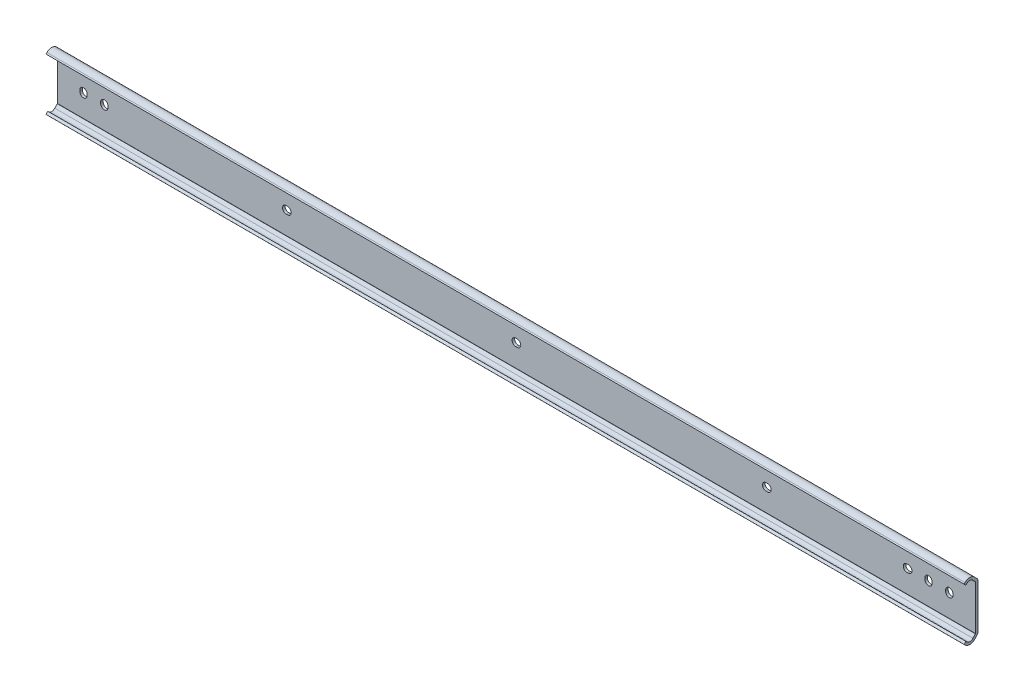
ISO-10303-21;
HEADER;
FILE_DESCRIPTION(('STEP AP214'),'2;1');
FILE_NAME('part.step','',(''),(''),'','','');
FILE_SCHEMA(('AUTOMOTIVE_DESIGN { 1 0 10303 214 1 1 1 1 }'));
ENDSEC;
DATA;
#1=APPLICATION_CONTEXT('core data for automotive mechanical design processes');
#2=APPLICATION_PROTOCOL_DEFINITION('international standard','automotive_design',2000,#1);
#3=PRODUCT_CONTEXT('',#1,'mechanical');
#4=PRODUCT('Part','Part','',(#3));
#5=PRODUCT_RELATED_PRODUCT_CATEGORY('part','',(#4));
#6=PRODUCT_DEFINITION_FORMATION('','',#4);
#7=PRODUCT_DEFINITION_CONTEXT('part definition',#1,'design');
#8=PRODUCT_DEFINITION('design','',#6,#7);
#9=PRODUCT_DEFINITION_SHAPE('','',#8);
#10=(LENGTH_UNIT() NAMED_UNIT(*) SI_UNIT(.MILLI.,.METRE.));
#11=(NAMED_UNIT(*) PLANE_ANGLE_UNIT() SI_UNIT($,.RADIAN.));
#12=(NAMED_UNIT(*) SI_UNIT($,.STERADIAN.) SOLID_ANGLE_UNIT());
#13=UNCERTAINTY_MEASURE_WITH_UNIT(LENGTH_MEASURE(1.E-05),#10,'distance_accuracy_value','');
#14=(GEOMETRIC_REPRESENTATION_CONTEXT(3) GLOBAL_UNCERTAINTY_ASSIGNED_CONTEXT((#13)) GLOBAL_UNIT_ASSIGNED_CONTEXT((#10,
#11,#12)) REPRESENTATION_CONTEXT('',''));
#15=CARTESIAN_POINT('',(0.,0.,0.));
#16=DIRECTION('',(0.,0.,1.));
#17=DIRECTION('',(1.,0.,0.));
#18=AXIS2_PLACEMENT_3D('',#15,#16,#17);
#19=CARTESIAN_POINT('',(-15.9,13.5610179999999,1.54999923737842));
#20=DIRECTION('',(0.,0.,-1.));
#21=DIRECTION('',(1.,0.,0.));
#22=AXIS2_PLACEMENT_3D('',#19,#20,#21);
#23=PLANE('',#22);
#24=DIRECTION('',(0.,1.,0.));
#25=VECTOR('',#24,1.);
#26=CARTESIAN_POINT('',(542.9,13.5610179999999,1.54999923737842));
#27=LINE('',#26,#25);
#28=CARTESIAN_POINT('',(542.9,-13.5610179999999,1.54999923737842));
#29=VERTEX_POINT('',#28);
#30=CARTESIAN_POINT('',(542.9,13.5610179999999,1.54999923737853));
#31=VERTEX_POINT('',#30);
#32=EDGE_CURVE('E614',#29,#31,#27,.T.);
#33=ORIENTED_EDGE('',*,*,#32,.T.);
#34=DIRECTION('',(1.,0.,0.));
#35=VECTOR('',#34,1.);
#36=CARTESIAN_POINT('',(-15.9,13.5610179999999,1.54999923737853));
#37=LINE('',#36,#35);
#38=CARTESIAN_POINT('',(-15.9,13.5610179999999,1.54999923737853));
#39=VERTEX_POINT('',#38);
#40=EDGE_CURVE('E707',#39,#31,#37,.T.);
#41=ORIENTED_EDGE('',*,*,#40,.F.);
#42=DIRECTION('',(0.,1.,0.));
#43=VECTOR('',#42,1.);
#44=CARTESIAN_POINT('',(-15.9,13.5610179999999,1.54999923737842));
#45=LINE('',#44,#43);
#46=CARTESIAN_POINT('',(-15.9,-13.5610179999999,1.54999923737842));
#47=VERTEX_POINT('',#46);
#48=EDGE_CURVE('E655',#47,#39,#45,.T.);
#49=ORIENTED_EDGE('',*,*,#48,.F.);
#50=DIRECTION('',(1.,0.,0.));
#51=VECTOR('',#50,1.);
#52=CARTESIAN_POINT('',(-15.9,-13.5610179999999,1.54999923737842));
#53=LINE('',#52,#51);
#54=EDGE_CURVE('E710',#47,#29,#53,.T.);
#55=ORIENTED_EDGE('',*,*,#54,.T.);
#56=EDGE_LOOP('',(#33,#41,#49,#55));
#57=FACE_BOUND('',#56,.T.);
#58=DIRECTION('',(1.,0.,0.));
#59=VECTOR('',#58,1.);
#60=CARTESIAN_POINT('',(123.4,-2.25,1.54999923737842));
#61=LINE('',#60,#59);
#62=CARTESIAN_POINT('',(123.4,-2.25,1.54999923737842));
#63=VERTEX_POINT('',#62);
#64=CARTESIAN_POINT('',(124.2,-2.25,1.54999923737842));
#65=VERTEX_POINT('',#64);
#66=EDGE_CURVE('E362',#63,#65,#61,.T.);
#67=ORIENTED_EDGE('',*,*,#66,.F.);
#68=CARTESIAN_POINT('',(123.4,0.,1.54999923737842));
#69=DIRECTION('',(0.,0.,-1.));
#70=DIRECTION('',(1.,0.,0.));
#71=AXIS2_PLACEMENT_3D('',#68,#69,#70);
#72=CIRCLE('',#71,2.25);
#73=CARTESIAN_POINT('',(123.4,2.25,1.54999923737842));
#74=VERTEX_POINT('',#73);
#75=EDGE_CURVE('E345',#74,#63,#72,.F.);
#76=ORIENTED_EDGE('',*,*,#75,.F.);
#77=DIRECTION('',(-1.,0.,0.));
#78=VECTOR('',#77,1.);
#79=CARTESIAN_POINT('',(124.2,2.25,1.54999923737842));
#80=LINE('',#79,#78);
#81=CARTESIAN_POINT('',(124.2,2.25,1.54999923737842));
#82=VERTEX_POINT('',#81);
#83=EDGE_CURVE('E354',#82,#74,#80,.T.);
#84=ORIENTED_EDGE('',*,*,#83,.F.);
#85=CARTESIAN_POINT('',(124.2,0.,1.54999923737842));
#86=DIRECTION('',(0.,0.,-1.));
#87=DIRECTION('',(1.,0.,0.));
#88=AXIS2_PLACEMENT_3D('',#85,#86,#87);
#89=CIRCLE('',#88,2.25);
#90=EDGE_CURVE('E29',#65,#82,#89,.F.);
#91=ORIENTED_EDGE('',*,*,#90,.F.);
#92=EDGE_LOOP('',(#67,#76,#84,#91));
#93=FACE_BOUND('',#92,.T.);
#94=DIRECTION('',(1.,0.,0.));
#95=VECTOR('',#94,1.);
#96=CARTESIAN_POINT('',(263.1,-2.25,1.54999923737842));
#97=LINE('',#96,#95);
#98=CARTESIAN_POINT('',(263.1,-2.25,1.54999923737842));
#99=VERTEX_POINT('',#98);
#100=CARTESIAN_POINT('',(263.9,-2.25,1.54999923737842));
#101=VERTEX_POINT('',#100);
#102=EDGE_CURVE('E380',#99,#101,#97,.T.);
#103=ORIENTED_EDGE('',*,*,#102,.F.);
#104=CARTESIAN_POINT('',(263.1,0.,1.54999923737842));
#105=DIRECTION('',(0.,0.,-1.));
#106=DIRECTION('',(1.,0.,0.));
#107=AXIS2_PLACEMENT_3D('',#104,#105,#106);
#108=CIRCLE('',#107,2.25);
#109=CARTESIAN_POINT('',(263.1,2.25,1.54999923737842));
#110=VERTEX_POINT('',#109);
#111=EDGE_CURVE('E383',#110,#99,#108,.F.);
#112=ORIENTED_EDGE('',*,*,#111,.F.);
#113=DIRECTION('',(-1.,0.,0.));
#114=VECTOR('',#113,1.);
#115=CARTESIAN_POINT('',(263.9,2.25,1.54999923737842));
#116=LINE('',#115,#114);
#117=CARTESIAN_POINT('',(263.9,2.25,1.54999923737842));
#118=VERTEX_POINT('',#117);
#119=EDGE_CURVE('E400',#118,#110,#116,.T.);
#120=ORIENTED_EDGE('',*,*,#119,.F.);
#121=CARTESIAN_POINT('',(263.9,0.,1.54999923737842));
#122=DIRECTION('',(0.,0.,-1.));
#123=DIRECTION('',(1.,0.,0.));
#124=AXIS2_PLACEMENT_3D('',#121,#122,#123);
#125=CIRCLE('',#124,2.25);
#126=EDGE_CURVE('E357',#101,#118,#125,.F.);
#127=ORIENTED_EDGE('',*,*,#126,.F.);
#128=EDGE_LOOP('',(#103,#112,#120,#127));
#129=FACE_BOUND('',#128,.T.);
#130=DIRECTION('',(0.,1.,0.));
#131=VECTOR('',#130,1.);
#132=CARTESIAN_POINT('',(2.25000000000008,-0.4,1.54999923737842));
#133=LINE('',#132,#131);
#134=CARTESIAN_POINT('',(2.25000000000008,-0.4,1.54999923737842));
#135=VERTEX_POINT('',#134);
#136=CARTESIAN_POINT('',(2.25000000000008,0.4,1.54999923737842));
#137=VERTEX_POINT('',#136);
#138=EDGE_CURVE('E411',#135,#137,#133,.T.);
#139=ORIENTED_EDGE('',*,*,#138,.F.);
#140=CARTESIAN_POINT('',(0.,-0.4,1.54999923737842));
#141=DIRECTION('',(0.,0.,-1.));
#142=DIRECTION('',(1.,0.,0.));
#143=AXIS2_PLACEMENT_3D('',#140,#141,#142);
#144=CIRCLE('',#143,2.25000000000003);
#145=CARTESIAN_POINT('',(-2.24999999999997,-0.4,1.54999923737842));
#146=VERTEX_POINT('',#145);
#147=EDGE_CURVE('E414',#146,#135,#144,.F.);
#148=ORIENTED_EDGE('',*,*,#147,.F.);
#149=DIRECTION('',(0.,-1.,0.));
#150=VECTOR('',#149,1.);
#151=CARTESIAN_POINT('',(-2.24999999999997,0.4,1.54999923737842));
#152=LINE('',#151,#150);
#153=CARTESIAN_POINT('',(-2.24999999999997,0.4,1.54999923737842));
#154=VERTEX_POINT('',#153);
#155=EDGE_CURVE('E431',#154,#146,#152,.T.);
#156=ORIENTED_EDGE('',*,*,#155,.F.);
#157=CARTESIAN_POINT('',(0.,0.4,1.54999923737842));
#158=DIRECTION('',(0.,0.,-1.));
#159=DIRECTION('',(1.,0.,0.));
#160=AXIS2_PLACEMENT_3D('',#157,#158,#159);
#161=CIRCLE('',#160,2.25000000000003);
#162=EDGE_CURVE('E409',#137,#154,#161,.F.);
#163=ORIENTED_EDGE('',*,*,#162,.F.);
#164=EDGE_LOOP('',(#139,#148,#156,#163));
#165=FACE_BOUND('',#164,.T.);
#166=DIRECTION('',(0.,1.,0.));
#167=VECTOR('',#166,1.);
#168=CARTESIAN_POINT('',(14.95,-0.4,1.54999923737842));
#169=LINE('',#168,#167);
#170=CARTESIAN_POINT('',(14.95,-0.4,1.54999923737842));
#171=VERTEX_POINT('',#170);
#172=CARTESIAN_POINT('',(14.95,0.4,1.54999923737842));
#173=VERTEX_POINT('',#172);
#174=EDGE_CURVE('E442',#171,#173,#169,.T.);
#175=ORIENTED_EDGE('',*,*,#174,.F.);
#176=CARTESIAN_POINT('',(12.7,-0.4,1.54999923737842));
#177=DIRECTION('',(0.,0.,-1.));
#178=DIRECTION('',(1.,0.,0.));
#179=AXIS2_PLACEMENT_3D('',#176,#177,#178);
#180=CIRCLE('',#179,2.25000000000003);
#181=CARTESIAN_POINT('',(10.45,-0.4,1.54999923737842));
#182=VERTEX_POINT('',#181);
#183=EDGE_CURVE('E445',#182,#171,#180,.F.);
#184=ORIENTED_EDGE('',*,*,#183,.F.);
#185=DIRECTION('',(0.,-1.,0.));
#186=VECTOR('',#185,1.);
#187=CARTESIAN_POINT('',(10.45,0.4,1.54999923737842));
#188=LINE('',#187,#186);
#189=CARTESIAN_POINT('',(10.45,0.4,1.54999923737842));
#190=VERTEX_POINT('',#189);
#191=EDGE_CURVE('E462',#190,#182,#188,.T.);
#192=ORIENTED_EDGE('',*,*,#191,.F.);
#193=CARTESIAN_POINT('',(12.7,0.4,1.54999923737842));
#194=DIRECTION('',(0.,0.,-1.));
#195=DIRECTION('',(1.,0.,0.));
#196=AXIS2_PLACEMENT_3D('',#193,#194,#195);
#197=CIRCLE('',#196,2.25000000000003);
#198=EDGE_CURVE('E440',#173,#190,#197,.F.);
#199=ORIENTED_EDGE('',*,*,#198,.F.);
#200=EDGE_LOOP('',(#175,#184,#192,#199));
#201=FACE_BOUND('',#200,.T.);
#202=DIRECTION('',(0.,1.,0.));
#203=VECTOR('',#202,1.);
#204=CARTESIAN_POINT('',(529.25,-0.4,1.54999923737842));
#205=LINE('',#204,#203);
#206=CARTESIAN_POINT('',(529.25,-0.4,1.54999923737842));
#207=VERTEX_POINT('',#206);
#208=CARTESIAN_POINT('',(529.25,0.4,1.54999923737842));
#209=VERTEX_POINT('',#208);
#210=EDGE_CURVE('E473',#207,#209,#205,.T.);
#211=ORIENTED_EDGE('',*,*,#210,.F.);
#212=CARTESIAN_POINT('',(527.,-0.4,1.54999923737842));
#213=DIRECTION('',(0.,0.,-1.));
#214=DIRECTION('',(1.,0.,0.));
#215=AXIS2_PLACEMENT_3D('',#212,#213,#214);
#216=CIRCLE('',#215,2.25);
#217=CARTESIAN_POINT('',(524.75,-0.4,1.54999923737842));
#218=VERTEX_POINT('',#217);
#219=EDGE_CURVE('E476',#218,#207,#216,.F.);
#220=ORIENTED_EDGE('',*,*,#219,.F.);
#221=DIRECTION('',(0.,-1.,0.));
#222=VECTOR('',#221,1.);
#223=CARTESIAN_POINT('',(524.75,0.4,1.54999923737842));
#224=LINE('',#223,#222);
#225=CARTESIAN_POINT('',(524.75,0.4,1.54999923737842));
#226=VERTEX_POINT('',#225);
#227=EDGE_CURVE('E493',#226,#218,#224,.T.);
#228=ORIENTED_EDGE('',*,*,#227,.F.);
#229=CARTESIAN_POINT('',(527.,0.4,1.54999923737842));
#230=DIRECTION('',(0.,0.,-1.));
#231=DIRECTION('',(1.,0.,0.));
#232=AXIS2_PLACEMENT_3D('',#229,#230,#231);
#233=CIRCLE('',#232,2.25);
#234=EDGE_CURVE('E471',#209,#226,#233,.F.);
#235=ORIENTED_EDGE('',*,*,#234,.F.);
#236=EDGE_LOOP('',(#211,#220,#228,#235));
#237=FACE_BOUND('',#236,.T.);
#238=DIRECTION('',(1.,0.,0.));
#239=VECTOR('',#238,1.);
#240=CARTESIAN_POINT('',(501.2,-2.25,1.54999923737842));
#241=LINE('',#240,#239);
#242=CARTESIAN_POINT('',(501.2,-2.25,1.54999923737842));
#243=VERTEX_POINT('',#242);
#244=CARTESIAN_POINT('',(502.,-2.25,1.54999923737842));
#245=VERTEX_POINT('',#244);
#246=EDGE_CURVE('E504',#243,#245,#241,.T.);
#247=ORIENTED_EDGE('',*,*,#246,.F.);
#248=CARTESIAN_POINT('',(501.2,0.,1.54999923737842));
#249=DIRECTION('',(0.,0.,-1.));
#250=DIRECTION('',(1.,0.,0.));
#251=AXIS2_PLACEMENT_3D('',#248,#249,#250);
#252=CIRCLE('',#251,2.25);
#253=CARTESIAN_POINT('',(501.2,2.25,1.54999923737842));
#254=VERTEX_POINT('',#253);
#255=EDGE_CURVE('E507',#254,#243,#252,.F.);
#256=ORIENTED_EDGE('',*,*,#255,.F.);
#257=DIRECTION('',(-1.,0.,0.));
#258=VECTOR('',#257,1.);
#259=CARTESIAN_POINT('',(502.,2.25,1.54999923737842));
#260=LINE('',#259,#258);
#261=CARTESIAN_POINT('',(502.,2.25,1.54999923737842));
#262=VERTEX_POINT('',#261);
#263=EDGE_CURVE('E524',#262,#254,#260,.T.);
#264=ORIENTED_EDGE('',*,*,#263,.F.);
#265=CARTESIAN_POINT('',(502.,0.,1.54999923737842));
#266=DIRECTION('',(0.,0.,-1.));
#267=DIRECTION('',(1.,0.,0.));
#268=AXIS2_PLACEMENT_3D('',#265,#266,#267);
#269=CIRCLE('',#268,2.25);
#270=EDGE_CURVE('E502',#245,#262,#269,.F.);
#271=ORIENTED_EDGE('',*,*,#270,.F.);
#272=EDGE_LOOP('',(#247,#256,#264,#271));
#273=FACE_BOUND('',#272,.T.);
#274=DIRECTION('',(0.,1.,0.));
#275=VECTOR('',#274,1.);
#276=CARTESIAN_POINT('',(516.55,-0.4,1.54999923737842));
#277=LINE('',#276,#275);
#278=CARTESIAN_POINT('',(516.55,-0.4,1.54999923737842));
#279=VERTEX_POINT('',#278);
#280=CARTESIAN_POINT('',(516.55,0.4,1.54999923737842));
#281=VERTEX_POINT('',#280);
#282=EDGE_CURVE('E535',#279,#281,#277,.T.);
#283=ORIENTED_EDGE('',*,*,#282,.F.);
#284=CARTESIAN_POINT('',(514.3,-0.4,1.54999923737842));
#285=DIRECTION('',(0.,0.,-1.));
#286=DIRECTION('',(1.,0.,0.));
#287=AXIS2_PLACEMENT_3D('',#284,#285,#286);
#288=CIRCLE('',#287,2.25);
#289=CARTESIAN_POINT('',(512.05,-0.4,1.54999923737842));
#290=VERTEX_POINT('',#289);
#291=EDGE_CURVE('E538',#290,#279,#288,.F.);
#292=ORIENTED_EDGE('',*,*,#291,.F.);
#293=DIRECTION('',(0.,-1.,0.));
#294=VECTOR('',#293,1.);
#295=CARTESIAN_POINT('',(512.05,0.4,1.54999923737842));
#296=LINE('',#295,#294);
#297=CARTESIAN_POINT('',(512.05,0.4,1.54999923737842));
#298=VERTEX_POINT('',#297);
#299=EDGE_CURVE('E555',#298,#290,#296,.T.);
#300=ORIENTED_EDGE('',*,*,#299,.F.);
#301=CARTESIAN_POINT('',(514.3,0.4,1.54999923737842));
#302=DIRECTION('',(0.,0.,-1.));
#303=DIRECTION('',(1.,0.,0.));
#304=AXIS2_PLACEMENT_3D('',#301,#302,#303);
#305=CIRCLE('',#304,2.25);
#306=EDGE_CURVE('E533',#281,#298,#305,.F.);
#307=ORIENTED_EDGE('',*,*,#306,.F.);
#308=EDGE_LOOP('',(#283,#292,#300,#307));
#309=FACE_BOUND('',#308,.T.);
#310=DIRECTION('',(1.,0.,0.));
#311=VECTOR('',#310,1.);
#312=CARTESIAN_POINT('',(415.5,-2.25,1.54999923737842));
#313=LINE('',#312,#311);
#314=CARTESIAN_POINT('',(415.5,-2.25,1.54999923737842));
#315=VERTEX_POINT('',#314);
#316=CARTESIAN_POINT('',(416.3,-2.25,1.54999923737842));
#317=VERTEX_POINT('',#316);
#318=EDGE_CURVE('E566',#315,#317,#313,.T.);
#319=ORIENTED_EDGE('',*,*,#318,.F.);
#320=CARTESIAN_POINT('',(415.5,0.,1.54999923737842));
#321=DIRECTION('',(0.,0.,-1.));
#322=DIRECTION('',(1.,0.,0.));
#323=AXIS2_PLACEMENT_3D('',#320,#321,#322);
#324=CIRCLE('',#323,2.25);
#325=CARTESIAN_POINT('',(415.5,2.25,1.54999923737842));
#326=VERTEX_POINT('',#325);
#327=EDGE_CURVE('E569',#326,#315,#324,.F.);
#328=ORIENTED_EDGE('',*,*,#327,.F.);
#329=DIRECTION('',(-1.,0.,0.));
#330=VECTOR('',#329,1.);
#331=CARTESIAN_POINT('',(416.3,2.25,1.54999923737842));
#332=LINE('',#331,#330);
#333=CARTESIAN_POINT('',(416.3,2.25,1.54999923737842));
#334=VERTEX_POINT('',#333);
#335=EDGE_CURVE('E586',#334,#326,#332,.T.);
#336=ORIENTED_EDGE('',*,*,#335,.F.);
#337=CARTESIAN_POINT('',(416.3,0.,1.54999923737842));
#338=DIRECTION('',(0.,0.,-1.));
#339=DIRECTION('',(1.,0.,0.));
#340=AXIS2_PLACEMENT_3D('',#337,#338,#339);
#341=CIRCLE('',#340,2.25);
#342=EDGE_CURVE('E564',#317,#334,#341,.F.);
#343=ORIENTED_EDGE('',*,*,#342,.F.);
#344=EDGE_LOOP('',(#319,#328,#336,#343));
#345=FACE_BOUND('',#344,.T.);
#346=ADVANCED_FACE('F14',(#57,#93,#129,#165,#201,#237,#273,#309,#345),#23,.F.);
#347=CARTESIAN_POINT('',(-15.9,13.5610176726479,0.));
#348=DIRECTION('',(0.,0.,1.));
#349=DIRECTION('',(-1.,0.,0.));
#350=AXIS2_PLACEMENT_3D('',#347,#348,#349);
#351=PLANE('',#350);
#352=DIRECTION('',(1.,0.,0.));
#353=VECTOR('',#352,1.);
#354=CARTESIAN_POINT('',(124.2,2.25,0.));
#355=LINE('',#354,#353);
#356=CARTESIAN_POINT('',(123.4,2.25,0.));
#357=VERTEX_POINT('',#356);
#358=CARTESIAN_POINT('',(124.2,2.25,0.));
#359=VERTEX_POINT('',#358);
#360=EDGE_CURVE('E364',#357,#359,#355,.T.);
#361=ORIENTED_EDGE('',*,*,#360,.F.);
#362=CARTESIAN_POINT('',(123.4,0.,0.));
#363=DIRECTION('',(0.,0.,-1.));
#364=DIRECTION('',(1.,0.,0.));
#365=AXIS2_PLACEMENT_3D('',#362,#363,#364);
#366=CIRCLE('',#365,2.25);
#367=CARTESIAN_POINT('',(123.4,-2.25,0.));
#368=VERTEX_POINT('',#367);
#369=EDGE_CURVE('E37',#368,#357,#366,.T.);
#370=ORIENTED_EDGE('',*,*,#369,.F.);
#371=DIRECTION('',(-1.,0.,0.));
#372=VECTOR('',#371,1.);
#373=CARTESIAN_POINT('',(123.4,-2.25,0.));
#374=LINE('',#373,#372);
#375=CARTESIAN_POINT('',(124.2,-2.25,0.));
#376=VERTEX_POINT('',#375);
#377=EDGE_CURVE('E351',#376,#368,#374,.T.);
#378=ORIENTED_EDGE('',*,*,#377,.F.);
#379=CARTESIAN_POINT('',(124.2,0.,0.));
#380=DIRECTION('',(0.,0.,-1.));
#381=DIRECTION('',(1.,0.,0.));
#382=AXIS2_PLACEMENT_3D('',#379,#380,#381);
#383=CIRCLE('',#382,2.25);
#384=EDGE_CURVE('E370',#359,#376,#383,.T.);
#385=ORIENTED_EDGE('',*,*,#384,.F.);
#386=EDGE_LOOP('',(#361,#370,#378,#385));
#387=FACE_BOUND('',#386,.T.);
#388=DIRECTION('',(1.,0.,0.));
#389=VECTOR('',#388,1.);
#390=CARTESIAN_POINT('',(263.9,2.25,0.));
#391=LINE('',#390,#389);
#392=CARTESIAN_POINT('',(263.1,2.25,0.));
#393=VERTEX_POINT('',#392);
#394=CARTESIAN_POINT('',(263.9,2.25,0.));
#395=VERTEX_POINT('',#394);
#396=EDGE_CURVE('E388',#393,#395,#391,.T.);
#397=ORIENTED_EDGE('',*,*,#396,.F.);
#398=CARTESIAN_POINT('',(263.1,0.,0.));
#399=DIRECTION('',(0.,0.,-1.));
#400=DIRECTION('',(1.,0.,0.));
#401=AXIS2_PLACEMENT_3D('',#398,#399,#400);
#402=CIRCLE('',#401,2.25);
#403=CARTESIAN_POINT('',(263.1,-2.25,0.));
#404=VERTEX_POINT('',#403);
#405=EDGE_CURVE('E386',#404,#393,#402,.T.);
#406=ORIENTED_EDGE('',*,*,#405,.F.);
#407=DIRECTION('',(-1.,0.,0.));
#408=VECTOR('',#407,1.);
#409=CARTESIAN_POINT('',(263.1,-2.25,0.));
#410=LINE('',#409,#408);
#411=CARTESIAN_POINT('',(263.9,-2.25,0.));
#412=VERTEX_POINT('',#411);
#413=EDGE_CURVE('E394',#412,#404,#410,.T.);
#414=ORIENTED_EDGE('',*,*,#413,.F.);
#415=CARTESIAN_POINT('',(263.9,0.,0.));
#416=DIRECTION('',(0.,0.,-1.));
#417=DIRECTION('',(1.,0.,0.));
#418=AXIS2_PLACEMENT_3D('',#415,#416,#417);
#419=CIRCLE('',#418,2.25);
#420=EDGE_CURVE('E391',#395,#412,#419,.T.);
#421=ORIENTED_EDGE('',*,*,#420,.F.);
#422=EDGE_LOOP('',(#397,#406,#414,#421));
#423=FACE_BOUND('',#422,.T.);
#424=DIRECTION('',(0.,1.,0.));
#425=VECTOR('',#424,1.);
#426=CARTESIAN_POINT('',(-2.24999999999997,0.4,0.));
#427=LINE('',#426,#425);
#428=CARTESIAN_POINT('',(-2.24999999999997,-0.4,0.));
#429=VERTEX_POINT('',#428);
#430=CARTESIAN_POINT('',(-2.24999999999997,0.4,0.));
#431=VERTEX_POINT('',#430);
#432=EDGE_CURVE('E419',#429,#431,#427,.T.);
#433=ORIENTED_EDGE('',*,*,#432,.F.);
#434=CARTESIAN_POINT('',(0.,-0.4,0.));
#435=DIRECTION('',(0.,0.,-1.));
#436=DIRECTION('',(1.,0.,0.));
#437=AXIS2_PLACEMENT_3D('',#434,#435,#436);
#438=CIRCLE('',#437,2.25000000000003);
#439=CARTESIAN_POINT('',(2.25000000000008,-0.4,0.));
#440=VERTEX_POINT('',#439);
#441=EDGE_CURVE('E417',#440,#429,#438,.T.);
#442=ORIENTED_EDGE('',*,*,#441,.F.);
#443=DIRECTION('',(0.,-1.,0.));
#444=VECTOR('',#443,1.);
#445=CARTESIAN_POINT('',(2.25000000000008,-0.4,0.));
#446=LINE('',#445,#444);
#447=CARTESIAN_POINT('',(2.25000000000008,0.4,0.));
#448=VERTEX_POINT('',#447);
#449=EDGE_CURVE('E425',#448,#440,#446,.T.);
#450=ORIENTED_EDGE('',*,*,#449,.F.);
#451=CARTESIAN_POINT('',(0.,0.4,0.));
#452=DIRECTION('',(0.,0.,-1.));
#453=DIRECTION('',(1.,0.,0.));
#454=AXIS2_PLACEMENT_3D('',#451,#452,#453);
#455=CIRCLE('',#454,2.25000000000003);
#456=EDGE_CURVE('E422',#431,#448,#455,.T.);
#457=ORIENTED_EDGE('',*,*,#456,.F.);
#458=EDGE_LOOP('',(#433,#442,#450,#457));
#459=FACE_BOUND('',#458,.T.);
#460=DIRECTION('',(0.,1.,0.));
#461=VECTOR('',#460,1.);
#462=CARTESIAN_POINT('',(10.45,0.4,0.));
#463=LINE('',#462,#461);
#464=CARTESIAN_POINT('',(10.45,-0.4,0.));
#465=VERTEX_POINT('',#464);
#466=CARTESIAN_POINT('',(10.45,0.4,0.));
#467=VERTEX_POINT('',#466);
#468=EDGE_CURVE('E450',#465,#467,#463,.T.);
#469=ORIENTED_EDGE('',*,*,#468,.F.);
#470=CARTESIAN_POINT('',(12.7,-0.4,0.));
#471=DIRECTION('',(0.,0.,-1.));
#472=DIRECTION('',(1.,0.,0.));
#473=AXIS2_PLACEMENT_3D('',#470,#471,#472);
#474=CIRCLE('',#473,2.25000000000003);
#475=CARTESIAN_POINT('',(14.95,-0.4,0.));
#476=VERTEX_POINT('',#475);
#477=EDGE_CURVE('E448',#476,#465,#474,.T.);
#478=ORIENTED_EDGE('',*,*,#477,.F.);
#479=DIRECTION('',(0.,-1.,0.));
#480=VECTOR('',#479,1.);
#481=CARTESIAN_POINT('',(14.95,-0.4,0.));
#482=LINE('',#481,#480);
#483=CARTESIAN_POINT('',(14.95,0.4,0.));
#484=VERTEX_POINT('',#483);
#485=EDGE_CURVE('E456',#484,#476,#482,.T.);
#486=ORIENTED_EDGE('',*,*,#485,.F.);
#487=CARTESIAN_POINT('',(12.7,0.4,0.));
#488=DIRECTION('',(0.,0.,-1.));
#489=DIRECTION('',(1.,0.,0.));
#490=AXIS2_PLACEMENT_3D('',#487,#488,#489);
#491=CIRCLE('',#490,2.25000000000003);
#492=EDGE_CURVE('E453',#467,#484,#491,.T.);
#493=ORIENTED_EDGE('',*,*,#492,.F.);
#494=EDGE_LOOP('',(#469,#478,#486,#493));
#495=FACE_BOUND('',#494,.T.);
#496=DIRECTION('',(0.,1.,0.));
#497=VECTOR('',#496,1.);
#498=CARTESIAN_POINT('',(524.75,0.4,0.));
#499=LINE('',#498,#497);
#500=CARTESIAN_POINT('',(524.75,-0.4,0.));
#501=VERTEX_POINT('',#500);
#502=CARTESIAN_POINT('',(524.75,0.4,0.));
#503=VERTEX_POINT('',#502);
#504=EDGE_CURVE('E481',#501,#503,#499,.T.);
#505=ORIENTED_EDGE('',*,*,#504,.F.);
#506=CARTESIAN_POINT('',(527.,-0.4,0.));
#507=DIRECTION('',(0.,0.,-1.));
#508=DIRECTION('',(1.,0.,0.));
#509=AXIS2_PLACEMENT_3D('',#506,#507,#508);
#510=CIRCLE('',#509,2.25);
#511=CARTESIAN_POINT('',(529.25,-0.4,0.));
#512=VERTEX_POINT('',#511);
#513=EDGE_CURVE('E479',#512,#501,#510,.T.);
#514=ORIENTED_EDGE('',*,*,#513,.F.);
#515=DIRECTION('',(0.,-1.,0.));
#516=VECTOR('',#515,1.);
#517=CARTESIAN_POINT('',(529.25,-0.4,0.));
#518=LINE('',#517,#516);
#519=CARTESIAN_POINT('',(529.25,0.4,0.));
#520=VERTEX_POINT('',#519);
#521=EDGE_CURVE('E487',#520,#512,#518,.T.);
#522=ORIENTED_EDGE('',*,*,#521,.F.);
#523=CARTESIAN_POINT('',(527.,0.4,0.));
#524=DIRECTION('',(0.,0.,-1.));
#525=DIRECTION('',(1.,0.,0.));
#526=AXIS2_PLACEMENT_3D('',#523,#524,#525);
#527=CIRCLE('',#526,2.25);
#528=EDGE_CURVE('E484',#503,#520,#527,.T.);
#529=ORIENTED_EDGE('',*,*,#528,.F.);
#530=EDGE_LOOP('',(#505,#514,#522,#529));
#531=FACE_BOUND('',#530,.T.);
#532=DIRECTION('',(1.,0.,0.));
#533=VECTOR('',#532,1.);
#534=CARTESIAN_POINT('',(502.,2.25,0.));
#535=LINE('',#534,#533);
#536=CARTESIAN_POINT('',(501.2,2.25,0.));
#537=VERTEX_POINT('',#536);
#538=CARTESIAN_POINT('',(502.,2.25,0.));
#539=VERTEX_POINT('',#538);
#540=EDGE_CURVE('E512',#537,#539,#535,.T.);
#541=ORIENTED_EDGE('',*,*,#540,.F.);
#542=CARTESIAN_POINT('',(501.2,0.,0.));
#543=DIRECTION('',(0.,0.,-1.));
#544=DIRECTION('',(1.,0.,0.));
#545=AXIS2_PLACEMENT_3D('',#542,#543,#544);
#546=CIRCLE('',#545,2.25);
#547=CARTESIAN_POINT('',(501.2,-2.25,0.));
#548=VERTEX_POINT('',#547);
#549=EDGE_CURVE('E510',#548,#537,#546,.T.);
#550=ORIENTED_EDGE('',*,*,#549,.F.);
#551=DIRECTION('',(-1.,0.,0.));
#552=VECTOR('',#551,1.);
#553=CARTESIAN_POINT('',(501.2,-2.25,0.));
#554=LINE('',#553,#552);
#555=CARTESIAN_POINT('',(502.,-2.25,0.));
#556=VERTEX_POINT('',#555);
#557=EDGE_CURVE('E518',#556,#548,#554,.T.);
#558=ORIENTED_EDGE('',*,*,#557,.F.);
#559=CARTESIAN_POINT('',(502.,0.,0.));
#560=DIRECTION('',(0.,0.,-1.));
#561=DIRECTION('',(1.,0.,0.));
#562=AXIS2_PLACEMENT_3D('',#559,#560,#561);
#563=CIRCLE('',#562,2.25);
#564=EDGE_CURVE('E515',#539,#556,#563,.T.);
#565=ORIENTED_EDGE('',*,*,#564,.F.);
#566=EDGE_LOOP('',(#541,#550,#558,#565));
#567=FACE_BOUND('',#566,.T.);
#568=DIRECTION('',(0.,1.,0.));
#569=VECTOR('',#568,1.);
#570=CARTESIAN_POINT('',(512.05,0.4,0.));
#571=LINE('',#570,#569);
#572=CARTESIAN_POINT('',(512.05,-0.4,0.));
#573=VERTEX_POINT('',#572);
#574=CARTESIAN_POINT('',(512.05,0.4,0.));
#575=VERTEX_POINT('',#574);
#576=EDGE_CURVE('E543',#573,#575,#571,.T.);
#577=ORIENTED_EDGE('',*,*,#576,.F.);
#578=CARTESIAN_POINT('',(514.3,-0.4,0.));
#579=DIRECTION('',(0.,0.,-1.));
#580=DIRECTION('',(1.,0.,0.));
#581=AXIS2_PLACEMENT_3D('',#578,#579,#580);
#582=CIRCLE('',#581,2.25);
#583=CARTESIAN_POINT('',(516.55,-0.4,0.));
#584=VERTEX_POINT('',#583);
#585=EDGE_CURVE('E541',#584,#573,#582,.T.);
#586=ORIENTED_EDGE('',*,*,#585,.F.);
#587=DIRECTION('',(0.,-1.,0.));
#588=VECTOR('',#587,1.);
#589=CARTESIAN_POINT('',(516.55,-0.4,0.));
#590=LINE('',#589,#588);
#591=CARTESIAN_POINT('',(516.55,0.4,0.));
#592=VERTEX_POINT('',#591);
#593=EDGE_CURVE('E549',#592,#584,#590,.T.);
#594=ORIENTED_EDGE('',*,*,#593,.F.);
#595=CARTESIAN_POINT('',(514.3,0.4,0.));
#596=DIRECTION('',(0.,0.,-1.));
#597=DIRECTION('',(1.,0.,0.));
#598=AXIS2_PLACEMENT_3D('',#595,#596,#597);
#599=CIRCLE('',#598,2.25);
#600=EDGE_CURVE('E546',#575,#592,#599,.T.);
#601=ORIENTED_EDGE('',*,*,#600,.F.);
#602=EDGE_LOOP('',(#577,#586,#594,#601));
#603=FACE_BOUND('',#602,.T.);
#604=DIRECTION('',(1.,0.,0.));
#605=VECTOR('',#604,1.);
#606=CARTESIAN_POINT('',(416.3,2.25,0.));
#607=LINE('',#606,#605);
#608=CARTESIAN_POINT('',(415.5,2.25,0.));
#609=VERTEX_POINT('',#608);
#610=CARTESIAN_POINT('',(416.3,2.25,0.));
#611=VERTEX_POINT('',#610);
#612=EDGE_CURVE('E574',#609,#611,#607,.T.);
#613=ORIENTED_EDGE('',*,*,#612,.F.);
#614=CARTESIAN_POINT('',(415.5,0.,0.));
#615=DIRECTION('',(0.,0.,-1.));
#616=DIRECTION('',(1.,0.,0.));
#617=AXIS2_PLACEMENT_3D('',#614,#615,#616);
#618=CIRCLE('',#617,2.25);
#619=CARTESIAN_POINT('',(415.5,-2.25,0.));
#620=VERTEX_POINT('',#619);
#621=EDGE_CURVE('E572',#620,#609,#618,.T.);
#622=ORIENTED_EDGE('',*,*,#621,.F.);
#623=DIRECTION('',(-1.,0.,0.));
#624=VECTOR('',#623,1.);
#625=CARTESIAN_POINT('',(415.5,-2.25,0.));
#626=LINE('',#625,#624);
#627=CARTESIAN_POINT('',(416.3,-2.25,0.));
#628=VERTEX_POINT('',#627);
#629=EDGE_CURVE('E580',#628,#620,#626,.T.);
#630=ORIENTED_EDGE('',*,*,#629,.F.);
#631=CARTESIAN_POINT('',(416.3,0.,0.));
#632=DIRECTION('',(0.,0.,-1.));
#633=DIRECTION('',(1.,0.,0.));
#634=AXIS2_PLACEMENT_3D('',#631,#632,#633);
#635=CIRCLE('',#634,2.25);
#636=EDGE_CURVE('E577',#611,#628,#635,.T.);
#637=ORIENTED_EDGE('',*,*,#636,.F.);
#638=EDGE_LOOP('',(#613,#622,#630,#637));
#639=FACE_BOUND('',#638,.T.);
#640=DIRECTION('',(0.,-1.,0.));
#641=VECTOR('',#640,1.);
#642=CARTESIAN_POINT('',(542.9,13.5610176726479,0.));
#643=LINE('',#642,#641);
#644=CARTESIAN_POINT('',(542.9,13.5610176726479,0.));
#645=VERTEX_POINT('',#644);
#646=CARTESIAN_POINT('',(542.9,-13.5610176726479,0.));
#647=VERTEX_POINT('',#646);
#648=EDGE_CURVE('E634',#645,#647,#643,.T.);
#649=ORIENTED_EDGE('',*,*,#648,.T.);
#650=DIRECTION('',(1.,0.,0.));
#651=VECTOR('',#650,1.);
#652=CARTESIAN_POINT('',(-15.9,-13.5610176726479,0.));
#653=LINE('',#652,#651);
#654=CARTESIAN_POINT('',(-15.9,-13.5610176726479,0.));
#655=VERTEX_POINT('',#654);
#656=EDGE_CURVE('E677',#655,#647,#653,.T.);
#657=ORIENTED_EDGE('',*,*,#656,.F.);
#658=DIRECTION('',(0.,-1.,0.));
#659=VECTOR('',#658,1.);
#660=CARTESIAN_POINT('',(-15.9,13.5610176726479,0.));
#661=LINE('',#660,#659);
#662=CARTESIAN_POINT('',(-15.9,13.5610176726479,0.));
#663=VERTEX_POINT('',#662);
#664=EDGE_CURVE('E675',#663,#655,#661,.T.);
#665=ORIENTED_EDGE('',*,*,#664,.F.);
#666=DIRECTION('',(1.,0.,0.));
#667=VECTOR('',#666,1.);
#668=CARTESIAN_POINT('',(-15.9,13.5610176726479,0.));
#669=LINE('',#668,#667);
#670=EDGE_CURVE('E680',#663,#645,#669,.T.);
#671=ORIENTED_EDGE('',*,*,#670,.T.);
#672=EDGE_LOOP('',(#649,#657,#665,#671));
#673=FACE_BOUND('',#672,.T.);
#674=ADVANCED_FACE('F765',(#387,#423,#459,#495,#531,#567,#603,#639,#673),#351,.F.);
#675=CARTESIAN_POINT('',(-15.9,-13.5610175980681,1.80000204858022));
#676=DIRECTION('',(1.,0.,0.));
#677=DIRECTION('',(0.,0.,1.));
#678=AXIS2_PLACEMENT_3D('',#675,#676,#677);
#679=PLANE('',#678);
#680=ORIENTED_EDGE('',*,*,#48,.T.);
#681=CARTESIAN_POINT('',(-15.9,13.5610175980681,1.80000204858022));
#682=DIRECTION('',(1.,0.,0.));
#683=DIRECTION('',(0.,0.,1.));
#684=AXIS2_PLACEMENT_3D('',#681,#682,#683);
#685=CIRCLE('',#684,0.250002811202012);
#686=CARTESIAN_POINT('',(-15.9,13.7341215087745,1.61962344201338));
#687=VERTEX_POINT('',#686);
#688=EDGE_CURVE('E657',#39,#687,#685,.T.);
#689=ORIENTED_EDGE('',*,*,#688,.T.);
#690=DIRECTION('',(0.,0.72150413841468,0.692410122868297));
#691=VECTOR('',#690,1.);
#692=CARTESIAN_POINT('',(-15.9,13.7341215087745,1.61962344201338));
#693=LINE('',#692,#691);
#694=CARTESIAN_POINT('',(-15.9,15.2920521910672,3.11473194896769));
#695=VERTEX_POINT('',#694);
#696=EDGE_CURVE('E659',#687,#695,#693,.T.);
#697=ORIENTED_EDGE('',*,*,#696,.T.);
#698=CARTESIAN_POINT('',(-15.9,13.5750002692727,4.99999970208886));
#699=DIRECTION('',(1.,0.,0.));
#700=DIRECTION('',(0.,0.,1.));
#701=AXIS2_PLACEMENT_3D('',#698,#699,#700);
#702=CIRCLE('',#701,2.55000035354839);
#703=CARTESIAN_POINT('',(-15.9,15.2920597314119,6.88526058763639));
#704=VERTEX_POINT('',#703);
#705=EDGE_CURVE('E661',#695,#704,#702,.T.);
#706=ORIENTED_EDGE('',*,*,#705,.T.);
#707=DIRECTION('',(0.,-0.721504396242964,0.692409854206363));
#708=VECTOR('',#707,1.);
#709=CARTESIAN_POINT('',(-15.9,15.2920597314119,6.88526058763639));
#710=LINE('',#709,#708);
#711=CARTESIAN_POINT('',(-15.9,14.7934625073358,7.36375196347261));
#712=VERTEX_POINT('',#711);
#713=EDGE_CURVE('E663',#704,#712,#710,.T.);
#714=ORIENTED_EDGE('',*,*,#713,.T.);
#715=DIRECTION('',(0.,0.707106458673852,0.707107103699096));
#716=VECTOR('',#715,1.);
#717=CARTESIAN_POINT('',(-15.9,14.7934625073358,7.36375196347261));
#718=LINE('',#717,#716);
#719=CARTESIAN_POINT('',(-15.9,15.8897095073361,8.45999996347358));
#720=VERTEX_POINT('',#719);
#721=EDGE_CURVE('E665',#712,#720,#718,.T.);
#722=ORIENTED_EDGE('',*,*,#721,.T.);
#723=DIRECTION('',(0.,0.721503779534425,-0.692410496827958));
#724=VECTOR('',#723,1.);
#725=CARTESIAN_POINT('',(-15.9,16.4741385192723,7.89913695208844));
#726=LINE('',#725,#724);
#727=CARTESIAN_POINT('',(-15.9,16.4741385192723,7.89913695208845));
#728=VERTEX_POINT('',#727);
#729=EDGE_CURVE('E667',#720,#728,#726,.T.);
#730=ORIENTED_EDGE('',*,*,#729,.T.);
#731=CARTESIAN_POINT('',(-15.9,13.5750002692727,4.99999970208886));
#732=DIRECTION('',(-1.,0.,0.));
#733=DIRECTION('',(0.,0.,-1.));
#734=AXIS2_PLACEMENT_3D('',#731,#732,#733);
#735=CIRCLE('',#734,4.09999992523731);
#736=CARTESIAN_POINT('',(-15.9,16.4741380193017,2.10086195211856));
#737=VERTEX_POINT('',#736);
#738=EDGE_CURVE('E669',#728,#737,#735,.T.);
#739=ORIENTED_EDGE('',*,*,#738,.T.);
#740=DIRECTION('',(0.,-0.721504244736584,-0.692410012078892));
#741=VECTOR('',#740,1.);
#742=CARTESIAN_POINT('',(-15.9,14.8073560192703,0.501291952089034));
#743=LINE('',#742,#741);
#744=CARTESIAN_POINT('',(-15.9,14.8073560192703,0.501291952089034));
#745=VERTEX_POINT('',#744);
#746=EDGE_CURVE('E671',#737,#745,#743,.T.);
#747=ORIENTED_EDGE('',*,*,#746,.T.);
#748=CARTESIAN_POINT('',(-15.9,13.5610175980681,1.80000204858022));
#749=DIRECTION('',(-1.,0.,0.));
#750=DIRECTION('',(0.,0.,-1.));
#751=AXIS2_PLACEMENT_3D('',#748,#749,#750);
#752=CIRCLE('',#751,1.80000204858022);
#753=EDGE_CURVE('E673',#745,#663,#752,.T.);
#754=ORIENTED_EDGE('',*,*,#753,.T.);
#755=ORIENTED_EDGE('',*,*,#664,.T.);
#756=CARTESIAN_POINT('',(-15.9,-13.5610175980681,1.80000204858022));
#757=DIRECTION('',(-1.,0.,0.));
#758=DIRECTION('',(0.,0.,1.));
#759=AXIS2_PLACEMENT_3D('',#756,#757,#758);
#760=CIRCLE('',#759,1.80000204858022);
#761=CARTESIAN_POINT('',(-15.9,-14.8073560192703,0.501291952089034));
#762=VERTEX_POINT('',#761);
#763=EDGE_CURVE('E636',#655,#762,#760,.T.);
#764=ORIENTED_EDGE('',*,*,#763,.T.);
#765=DIRECTION('',(0.,-0.721504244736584,0.692410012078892));
#766=VECTOR('',#765,1.);
#767=CARTESIAN_POINT('',(-15.9,-14.8073560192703,0.501291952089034));
#768=LINE('',#767,#766);
#769=CARTESIAN_POINT('',(-15.9,-16.4741380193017,2.10086195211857));
#770=VERTEX_POINT('',#769);
#771=EDGE_CURVE('E639',#762,#770,#768,.T.);
#772=ORIENTED_EDGE('',*,*,#771,.T.);
#773=CARTESIAN_POINT('',(-15.9,-13.5750002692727,4.99999970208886));
#774=DIRECTION('',(-1.,0.,0.));
#775=DIRECTION('',(0.,0.,1.));
#776=AXIS2_PLACEMENT_3D('',#773,#774,#775);
#777=CIRCLE('',#776,4.09999992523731);
#778=CARTESIAN_POINT('',(-15.9,-16.4741385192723,7.89913695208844));
#779=VERTEX_POINT('',#778);
#780=EDGE_CURVE('E641',#770,#779,#777,.T.);
#781=ORIENTED_EDGE('',*,*,#780,.T.);
#782=DIRECTION('',(0.,0.721503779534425,0.692410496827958));
#783=VECTOR('',#782,1.);
#784=CARTESIAN_POINT('',(-15.9,-16.4741385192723,7.89913695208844));
#785=LINE('',#784,#783);
#786=CARTESIAN_POINT('',(-15.9,-15.8897095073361,8.45999996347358));
#787=VERTEX_POINT('',#786);
#788=EDGE_CURVE('E643',#779,#787,#785,.T.);
#789=ORIENTED_EDGE('',*,*,#788,.T.);
#790=DIRECTION('',(0.,0.707106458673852,-0.707107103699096));
#791=VECTOR('',#790,1.);
#792=CARTESIAN_POINT('',(-15.9,-14.7934625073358,7.36375196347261));
#793=LINE('',#792,#791);
#794=CARTESIAN_POINT('',(-15.9,-14.7934625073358,7.36375196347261));
#795=VERTEX_POINT('',#794);
#796=EDGE_CURVE('E645',#787,#795,#793,.T.);
#797=ORIENTED_EDGE('',*,*,#796,.T.);
#798=DIRECTION('',(0.,-0.721504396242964,-0.692409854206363));
#799=VECTOR('',#798,1.);
#800=CARTESIAN_POINT('',(-15.9,-15.2920597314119,6.88526058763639));
#801=LINE('',#800,#799);
#802=CARTESIAN_POINT('',(-15.9,-15.2920597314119,6.88526058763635));
#803=VERTEX_POINT('',#802);
#804=EDGE_CURVE('E647',#795,#803,#801,.T.);
#805=ORIENTED_EDGE('',*,*,#804,.T.);
#806=CARTESIAN_POINT('',(-15.9,-13.5750002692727,4.99999970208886));
#807=DIRECTION('',(1.,0.,0.));
#808=DIRECTION('',(0.,0.,-1.));
#809=AXIS2_PLACEMENT_3D('',#806,#807,#808);
#810=CIRCLE('',#809,2.55000035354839);
#811=CARTESIAN_POINT('',(-15.9,-15.2920521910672,3.11473194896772));
#812=VERTEX_POINT('',#811);
#813=EDGE_CURVE('E649',#803,#812,#810,.T.);
#814=ORIENTED_EDGE('',*,*,#813,.T.);
#815=DIRECTION('',(0.,0.72150413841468,-0.692410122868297));
#816=VECTOR('',#815,1.);
#817=CARTESIAN_POINT('',(-15.9,-13.7341215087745,1.61962344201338));
#818=LINE('',#817,#816);
#819=CARTESIAN_POINT('',(-15.9,-13.7341215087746,1.6196234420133));
#820=VERTEX_POINT('',#819);
#821=EDGE_CURVE('E651',#812,#820,#818,.T.);
#822=ORIENTED_EDGE('',*,*,#821,.T.);
#823=CARTESIAN_POINT('',(-15.9,-13.5610175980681,1.80000204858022));
#824=DIRECTION('',(1.,0.,0.));
#825=DIRECTION('',(0.,0.,-1.));
#826=AXIS2_PLACEMENT_3D('',#823,#824,#825);
#827=CIRCLE('',#826,0.250002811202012);
#828=EDGE_CURVE('E653',#820,#47,#827,.T.);
#829=ORIENTED_EDGE('',*,*,#828,.T.);
#830=EDGE_LOOP('',(#680,#689,#697,#706,#714,#722,#730,#739,#747,#754,#755,#764,#772,#781,#789,
#797,#805,#814,#822,#829));
#831=FACE_BOUND('',#830,.T.);
#832=ADVANCED_FACE('F754',(#831),#679,.F.);
#833=CARTESIAN_POINT('',(542.9,-13.5610175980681,1.80000204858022));
#834=DIRECTION('',(1.,0.,0.));
#835=DIRECTION('',(0.,0.,1.));
#836=AXIS2_PLACEMENT_3D('',#833,#834,#835);
#837=PLANE('',#836);
#838=CARTESIAN_POINT('',(542.9,-13.5610175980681,1.80000204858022));
#839=DIRECTION('',(-1.,0.,0.));
#840=DIRECTION('',(0.,0.,1.));
#841=AXIS2_PLACEMENT_3D('',#838,#839,#840);
#842=CIRCLE('',#841,1.80000204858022);
#843=CARTESIAN_POINT('',(542.9,-14.8073560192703,0.501291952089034));
#844=VERTEX_POINT('',#843);
#845=EDGE_CURVE('E595',#647,#844,#842,.T.);
#846=ORIENTED_EDGE('',*,*,#845,.F.);
#847=ORIENTED_EDGE('',*,*,#648,.F.);
#848=CARTESIAN_POINT('',(542.9,13.5610175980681,1.80000204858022));
#849=DIRECTION('',(-1.,0.,0.));
#850=DIRECTION('',(0.,0.,-1.));
#851=AXIS2_PLACEMENT_3D('',#848,#849,#850);
#852=CIRCLE('',#851,1.80000204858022);
#853=CARTESIAN_POINT('',(542.9,14.8073560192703,0.501291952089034));
#854=VERTEX_POINT('',#853);
#855=EDGE_CURVE('E632',#854,#645,#852,.T.);
#856=ORIENTED_EDGE('',*,*,#855,.F.);
#857=DIRECTION('',(0.,-0.721504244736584,-0.692410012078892));
#858=VECTOR('',#857,1.);
#859=CARTESIAN_POINT('',(542.9,14.8073560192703,0.501291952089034));
#860=LINE('',#859,#858);
#861=CARTESIAN_POINT('',(542.9,16.4741380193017,2.10086195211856));
#862=VERTEX_POINT('',#861);
#863=EDGE_CURVE('E630',#862,#854,#860,.T.);
#864=ORIENTED_EDGE('',*,*,#863,.F.);
#865=CARTESIAN_POINT('',(542.9,13.5750002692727,4.99999970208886));
#866=DIRECTION('',(-1.,0.,0.));
#867=DIRECTION('',(0.,0.,-1.));
#868=AXIS2_PLACEMENT_3D('',#865,#866,#867);
#869=CIRCLE('',#868,4.09999992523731);
#870=CARTESIAN_POINT('',(542.9,16.4741385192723,7.89913695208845));
#871=VERTEX_POINT('',#870);
#872=EDGE_CURVE('E628',#871,#862,#869,.T.);
#873=ORIENTED_EDGE('',*,*,#872,.F.);
#874=DIRECTION('',(0.,0.721503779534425,-0.692410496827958));
#875=VECTOR('',#874,1.);
#876=CARTESIAN_POINT('',(542.9,16.4741385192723,7.89913695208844));
#877=LINE('',#876,#875);
#878=CARTESIAN_POINT('',(542.9,15.8897095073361,8.45999996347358));
#879=VERTEX_POINT('',#878);
#880=EDGE_CURVE('E626',#879,#871,#877,.T.);
#881=ORIENTED_EDGE('',*,*,#880,.F.);
#882=DIRECTION('',(0.,0.707106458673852,0.707107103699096));
#883=VECTOR('',#882,1.);
#884=CARTESIAN_POINT('',(542.9,14.7934625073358,7.36375196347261));
#885=LINE('',#884,#883);
#886=CARTESIAN_POINT('',(542.9,14.7934625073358,7.36375196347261));
#887=VERTEX_POINT('',#886);
#888=EDGE_CURVE('E624',#887,#879,#885,.T.);
#889=ORIENTED_EDGE('',*,*,#888,.F.);
#890=DIRECTION('',(0.,-0.721504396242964,0.692409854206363));
#891=VECTOR('',#890,1.);
#892=CARTESIAN_POINT('',(542.9,15.2920597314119,6.88526058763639));
#893=LINE('',#892,#891);
#894=CARTESIAN_POINT('',(542.9,15.2920597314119,6.88526058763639));
#895=VERTEX_POINT('',#894);
#896=EDGE_CURVE('E622',#895,#887,#893,.T.);
#897=ORIENTED_EDGE('',*,*,#896,.F.);
#898=CARTESIAN_POINT('',(542.9,13.5750002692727,4.99999970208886));
#899=DIRECTION('',(1.,0.,0.));
#900=DIRECTION('',(0.,0.,1.));
#901=AXIS2_PLACEMENT_3D('',#898,#899,#900);
#902=CIRCLE('',#901,2.55000035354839);
#903=CARTESIAN_POINT('',(542.9,15.2920521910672,3.11473194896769));
#904=VERTEX_POINT('',#903);
#905=EDGE_CURVE('E620',#904,#895,#902,.T.);
#906=ORIENTED_EDGE('',*,*,#905,.F.);
#907=DIRECTION('',(0.,0.72150413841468,0.692410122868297));
#908=VECTOR('',#907,1.);
#909=CARTESIAN_POINT('',(542.9,13.7341215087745,1.61962344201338));
#910=LINE('',#909,#908);
#911=CARTESIAN_POINT('',(542.9,13.7341215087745,1.61962344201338));
#912=VERTEX_POINT('',#911);
#913=EDGE_CURVE('E618',#912,#904,#910,.T.);
#914=ORIENTED_EDGE('',*,*,#913,.F.);
#915=CARTESIAN_POINT('',(542.9,13.5610175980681,1.80000204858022));
#916=DIRECTION('',(1.,0.,0.));
#917=DIRECTION('',(0.,0.,1.));
#918=AXIS2_PLACEMENT_3D('',#915,#916,#917);
#919=CIRCLE('',#918,0.250002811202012);
#920=EDGE_CURVE('E616',#31,#912,#919,.T.);
#921=ORIENTED_EDGE('',*,*,#920,.F.);
#922=ORIENTED_EDGE('',*,*,#32,.F.);
#923=CARTESIAN_POINT('',(542.9,-13.5610175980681,1.80000204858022));
#924=DIRECTION('',(1.,0.,0.));
#925=DIRECTION('',(0.,0.,-1.));
#926=AXIS2_PLACEMENT_3D('',#923,#924,#925);
#927=CIRCLE('',#926,0.250002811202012);
#928=CARTESIAN_POINT('',(542.9,-13.7341215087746,1.6196234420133));
#929=VERTEX_POINT('',#928);
#930=EDGE_CURVE('E612',#929,#29,#927,.T.);
#931=ORIENTED_EDGE('',*,*,#930,.F.);
#932=DIRECTION('',(0.,0.72150413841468,-0.692410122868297));
#933=VECTOR('',#932,1.);
#934=CARTESIAN_POINT('',(542.9,-13.7341215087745,1.61962344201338));
#935=LINE('',#934,#933);
#936=CARTESIAN_POINT('',(542.9,-15.2920521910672,3.11473194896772));
#937=VERTEX_POINT('',#936);
#938=EDGE_CURVE('E610',#937,#929,#935,.T.);
#939=ORIENTED_EDGE('',*,*,#938,.F.);
#940=CARTESIAN_POINT('',(542.9,-13.5750002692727,4.99999970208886));
#941=DIRECTION('',(1.,0.,0.));
#942=DIRECTION('',(0.,0.,-1.));
#943=AXIS2_PLACEMENT_3D('',#940,#941,#942);
#944=CIRCLE('',#943,2.55000035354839);
#945=CARTESIAN_POINT('',(542.9,-15.2920597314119,6.88526058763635));
#946=VERTEX_POINT('',#945);
#947=EDGE_CURVE('E608',#946,#937,#944,.T.);
#948=ORIENTED_EDGE('',*,*,#947,.F.);
#949=DIRECTION('',(0.,-0.721504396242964,-0.692409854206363));
#950=VECTOR('',#949,1.);
#951=CARTESIAN_POINT('',(542.9,-15.2920597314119,6.88526058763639));
#952=LINE('',#951,#950);
#953=CARTESIAN_POINT('',(542.9,-14.7934625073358,7.36375196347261));
#954=VERTEX_POINT('',#953);
#955=EDGE_CURVE('E606',#954,#946,#952,.T.);
#956=ORIENTED_EDGE('',*,*,#955,.F.);
#957=DIRECTION('',(0.,0.707106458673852,-0.707107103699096));
#958=VECTOR('',#957,1.);
#959=CARTESIAN_POINT('',(542.9,-14.7934625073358,7.36375196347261));
#960=LINE('',#959,#958);
#961=CARTESIAN_POINT('',(542.9,-15.8897095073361,8.45999996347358));
#962=VERTEX_POINT('',#961);
#963=EDGE_CURVE('E604',#962,#954,#960,.T.);
#964=ORIENTED_EDGE('',*,*,#963,.F.);
#965=DIRECTION('',(0.,0.721503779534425,0.692410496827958));
#966=VECTOR('',#965,1.);
#967=CARTESIAN_POINT('',(542.9,-16.4741385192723,7.89913695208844));
#968=LINE('',#967,#966);
#969=CARTESIAN_POINT('',(542.9,-16.4741385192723,7.89913695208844));
#970=VERTEX_POINT('',#969);
#971=EDGE_CURVE('E602',#970,#962,#968,.T.);
#972=ORIENTED_EDGE('',*,*,#971,.F.);
#973=CARTESIAN_POINT('',(542.9,-13.5750002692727,4.99999970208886));
#974=DIRECTION('',(-1.,0.,0.));
#975=DIRECTION('',(0.,0.,1.));
#976=AXIS2_PLACEMENT_3D('',#973,#974,#975);
#977=CIRCLE('',#976,4.09999992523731);
#978=CARTESIAN_POINT('',(542.9,-16.4741380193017,2.10086195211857));
#979=VERTEX_POINT('',#978);
#980=EDGE_CURVE('E600',#979,#970,#977,.T.);
#981=ORIENTED_EDGE('',*,*,#980,.F.);
#982=DIRECTION('',(0.,-0.721504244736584,0.692410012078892));
#983=VECTOR('',#982,1.);
#984=CARTESIAN_POINT('',(542.9,-14.8073560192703,0.501291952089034));
#985=LINE('',#984,#983);
#986=EDGE_CURVE('E598',#844,#979,#985,.T.);
#987=ORIENTED_EDGE('',*,*,#986,.F.);
#988=EDGE_LOOP('',(#846,#847,#856,#864,#873,#881,#889,#897,#906,#914,#921,#922,#931,#939,#948,
#956,#964,#972,#981,#987));
#989=FACE_BOUND('',#988,.T.);
#990=ADVANCED_FACE('F741',(#989),#837,.T.);
#991=CARTESIAN_POINT('',(-15.9,-13.5610175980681,1.80000204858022));
#992=DIRECTION('',(1.,0.,0.));
#993=DIRECTION('',(0.,0.,1.));
#994=AXIS2_PLACEMENT_3D('',#991,#992,#993);
#995=CYLINDRICAL_SURFACE('',#994,1.80000204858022);
#996=ORIENTED_EDGE('',*,*,#845,.T.);
#997=DIRECTION('',(1.,0.,0.));
#998=VECTOR('',#997,1.);
#999=CARTESIAN_POINT('',(-15.9,-14.8073560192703,0.501291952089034));
#1000=LINE('',#999,#998);
#1001=EDGE_CURVE('E9',#762,#844,#1000,.T.);
#1002=ORIENTED_EDGE('',*,*,#1001,.F.);
#1003=ORIENTED_EDGE('',*,*,#763,.F.);
#1004=ORIENTED_EDGE('',*,*,#656,.T.);
#1005=EDGE_LOOP('',(#996,#1002,#1003,#1004));
#1006=FACE_BOUND('',#1005,.T.);
#1007=ADVANCED_FACE('F16',(#1006),#995,.T.);
#1008=CARTESIAN_POINT('',(-15.9,-14.8073560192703,0.501291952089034));
#1009=DIRECTION('',(0.,0.692410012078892,0.721504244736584));
#1010=DIRECTION('',(0.,0.721504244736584,-0.692410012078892));
#1011=AXIS2_PLACEMENT_3D('',#1008,#1009,#1010);
#1012=PLANE('',#1011);
#1013=ORIENTED_EDGE('',*,*,#986,.T.);
#1014=DIRECTION('',(1.,0.,0.));
#1015=VECTOR('',#1014,1.);
#1016=CARTESIAN_POINT('',(-15.9,-16.4741380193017,2.10086195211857));
#1017=LINE('',#1016,#1015);
#1018=EDGE_CURVE('E22',#770,#979,#1017,.T.);
#1019=ORIENTED_EDGE('',*,*,#1018,.F.);
#1020=ORIENTED_EDGE('',*,*,#771,.F.);
#1021=ORIENTED_EDGE('',*,*,#1001,.T.);
#1022=EDGE_LOOP('',(#1013,#1019,#1020,#1021));
#1023=FACE_BOUND('',#1022,.T.);
#1024=ADVANCED_FACE('F758',(#1023),#1012,.F.);
#1025=CARTESIAN_POINT('',(-15.9,-13.5750002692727,4.99999970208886));
#1026=DIRECTION('',(1.,0.,0.));
#1027=DIRECTION('',(0.,0.,1.));
#1028=AXIS2_PLACEMENT_3D('',#1025,#1026,#1027);
#1029=CYLINDRICAL_SURFACE('',#1028,4.09999992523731);
#1030=DIRECTION('',(1.,0.,0.));
#1031=VECTOR('',#1030,1.);
#1032=CARTESIAN_POINT('',(-15.9,-16.4741385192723,7.89913695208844));
#1033=LINE('',#1032,#1031);
#1034=EDGE_CURVE('E728',#779,#970,#1033,.T.);
#1035=ORIENTED_EDGE('',*,*,#1034,.F.);
#1036=ORIENTED_EDGE('',*,*,#780,.F.);
#1037=ORIENTED_EDGE('',*,*,#1018,.T.);
#1038=ORIENTED_EDGE('',*,*,#980,.T.);
#1039=EDGE_LOOP('',(#1035,#1036,#1037,#1038));
#1040=FACE_BOUND('',#1039,.T.);
#1041=ADVANCED_FACE('F736',(#1040),#1029,.T.);
#1042=CARTESIAN_POINT('',(-15.9,-16.4741385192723,7.89913695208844));
#1043=DIRECTION('',(0.,0.692410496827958,-0.721503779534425));
#1044=DIRECTION('',(0.,-0.721503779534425,-0.692410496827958));
#1045=AXIS2_PLACEMENT_3D('',#1042,#1043,#1044);
#1046=PLANE('',#1045);
#1047=ORIENTED_EDGE('',*,*,#971,.T.);
#1048=DIRECTION('',(1.,0.,0.));
#1049=VECTOR('',#1048,1.);
#1050=CARTESIAN_POINT('',(-15.9,-15.8897095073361,8.45999996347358));
#1051=LINE('',#1050,#1049);
#1052=EDGE_CURVE('E725',#787,#962,#1051,.T.);
#1053=ORIENTED_EDGE('',*,*,#1052,.F.);
#1054=ORIENTED_EDGE('',*,*,#788,.F.);
#1055=ORIENTED_EDGE('',*,*,#1034,.T.);
#1056=EDGE_LOOP('',(#1047,#1053,#1054,#1055));
#1057=FACE_BOUND('',#1056,.T.);
#1058=ADVANCED_FACE('F746',(#1057),#1046,.F.);
#1059=CARTESIAN_POINT('',(-15.9,-14.7934625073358,7.36375196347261));
#1060=DIRECTION('',(0.,-0.707107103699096,-0.707106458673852));
#1061=DIRECTION('',(0.,-0.707106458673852,0.707107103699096));
#1062=AXIS2_PLACEMENT_3D('',#1059,#1060,#1061);
#1063=PLANE('',#1062);
#1064=ORIENTED_EDGE('',*,*,#963,.T.);
#1065=DIRECTION('',(1.,0.,0.));
#1066=VECTOR('',#1065,1.);
#1067=CARTESIAN_POINT('',(-15.9,-14.7934625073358,7.36375196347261));
#1068=LINE('',#1067,#1066);
#1069=EDGE_CURVE('E722',#795,#954,#1068,.T.);
#1070=ORIENTED_EDGE('',*,*,#1069,.F.);
#1071=ORIENTED_EDGE('',*,*,#796,.F.);
#1072=ORIENTED_EDGE('',*,*,#1052,.T.);
#1073=EDGE_LOOP('',(#1064,#1070,#1071,#1072));
#1074=FACE_BOUND('',#1073,.T.);
#1075=ADVANCED_FACE('F750',(#1074),#1063,.F.);
#1076=CARTESIAN_POINT('',(-15.9,-15.2920597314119,6.88526058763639));
#1077=DIRECTION('',(0.,-0.692409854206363,0.721504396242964));
#1078=DIRECTION('',(0.,0.721504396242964,0.692409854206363));
#1079=AXIS2_PLACEMENT_3D('',#1076,#1077,#1078);
#1080=PLANE('',#1079);
#1081=ORIENTED_EDGE('',*,*,#955,.T.);
#1082=DIRECTION('',(1.,0.,0.));
#1083=VECTOR('',#1082,1.);
#1084=CARTESIAN_POINT('',(-15.9,-15.2920597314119,6.88526058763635));
#1085=LINE('',#1084,#1083);
#1086=EDGE_CURVE('E719',#803,#946,#1085,.T.);
#1087=ORIENTED_EDGE('',*,*,#1086,.F.);
#1088=ORIENTED_EDGE('',*,*,#804,.F.);
#1089=ORIENTED_EDGE('',*,*,#1069,.T.);
#1090=EDGE_LOOP('',(#1081,#1087,#1088,#1089));
#1091=FACE_BOUND('',#1090,.T.);
#1092=ADVANCED_FACE('F830',(#1091),#1080,.F.);
#1093=CARTESIAN_POINT('',(-15.9,-13.5750002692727,4.99999970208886));
#1094=DIRECTION('',(1.,0.,0.));
#1095=DIRECTION('',(0.,0.,1.));
#1096=AXIS2_PLACEMENT_3D('',#1093,#1094,#1095);
#1097=CYLINDRICAL_SURFACE('',#1096,2.55000035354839);
#1098=ORIENTED_EDGE('',*,*,#947,.T.);
#1099=DIRECTION('',(1.,0.,0.));
#1100=VECTOR('',#1099,1.);
#1101=CARTESIAN_POINT('',(-15.9,-15.2920521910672,3.11473194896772));
#1102=LINE('',#1101,#1100);
#1103=EDGE_CURVE('E716',#812,#937,#1102,.T.);
#1104=ORIENTED_EDGE('',*,*,#1103,.F.);
#1105=ORIENTED_EDGE('',*,*,#813,.F.);
#1106=ORIENTED_EDGE('',*,*,#1086,.T.);
#1107=EDGE_LOOP('',(#1098,#1104,#1105,#1106));
#1108=FACE_BOUND('',#1107,.T.);
#1109=ADVANCED_FACE('F828',(#1108),#1097,.F.);
#1110=CARTESIAN_POINT('',(-15.9,-13.7341215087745,1.61962344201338));
#1111=DIRECTION('',(0.,-0.692410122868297,-0.72150413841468));
#1112=DIRECTION('',(0.,-0.72150413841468,0.692410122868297));
#1113=AXIS2_PLACEMENT_3D('',#1110,#1111,#1112);
#1114=PLANE('',#1113);
#1115=ORIENTED_EDGE('',*,*,#938,.T.);
#1116=DIRECTION('',(1.,0.,0.));
#1117=VECTOR('',#1116,1.);
#1118=CARTESIAN_POINT('',(-15.9,-13.7341215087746,1.6196234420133));
#1119=LINE('',#1118,#1117);
#1120=EDGE_CURVE('E713',#820,#929,#1119,.T.);
#1121=ORIENTED_EDGE('',*,*,#1120,.F.);
#1122=ORIENTED_EDGE('',*,*,#821,.F.);
#1123=ORIENTED_EDGE('',*,*,#1103,.T.);
#1124=EDGE_LOOP('',(#1115,#1121,#1122,#1123));
#1125=FACE_BOUND('',#1124,.T.);
#1126=ADVANCED_FACE('F823',(#1125),#1114,.F.);
#1127=CARTESIAN_POINT('',(-15.9,-13.5610175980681,1.80000204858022));
#1128=DIRECTION('',(1.,0.,0.));
#1129=DIRECTION('',(0.,0.,1.));
#1130=AXIS2_PLACEMENT_3D('',#1127,#1128,#1129);
#1131=CYLINDRICAL_SURFACE('',#1130,0.250002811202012);
#1132=ORIENTED_EDGE('',*,*,#930,.T.);
#1133=ORIENTED_EDGE('',*,*,#54,.F.);
#1134=ORIENTED_EDGE('',*,*,#828,.F.);
#1135=ORIENTED_EDGE('',*,*,#1120,.T.);
#1136=EDGE_LOOP('',(#1132,#1133,#1134,#1135));
#1137=FACE_BOUND('',#1136,.T.);
#1138=ADVANCED_FACE('F818',(#1137),#1131,.F.);
#1139=CARTESIAN_POINT('',(-15.9,13.5610175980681,1.80000204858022));
#1140=DIRECTION('',(1.,0.,0.));
#1141=DIRECTION('',(0.,0.,1.));
#1142=AXIS2_PLACEMENT_3D('',#1139,#1140,#1141);
#1143=CYLINDRICAL_SURFACE('',#1142,0.250002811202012);
#1144=ORIENTED_EDGE('',*,*,#920,.T.);
#1145=DIRECTION('',(1.,0.,0.));
#1146=VECTOR('',#1145,1.);
#1147=CARTESIAN_POINT('',(-15.9,13.7341215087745,1.61962344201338));
#1148=LINE('',#1147,#1146);
#1149=EDGE_CURVE('E704',#687,#912,#1148,.T.);
#1150=ORIENTED_EDGE('',*,*,#1149,.F.);
#1151=ORIENTED_EDGE('',*,*,#688,.F.);
#1152=ORIENTED_EDGE('',*,*,#40,.T.);
#1153=EDGE_LOOP('',(#1144,#1150,#1151,#1152));
#1154=FACE_BOUND('',#1153,.T.);
#1155=ADVANCED_FACE('F810',(#1154),#1143,.F.);
#1156=CARTESIAN_POINT('',(-15.9,13.7341215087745,1.61962344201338));
#1157=DIRECTION('',(0.,0.692410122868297,-0.72150413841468));
#1158=DIRECTION('',(0.,-0.72150413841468,-0.692410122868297));
#1159=AXIS2_PLACEMENT_3D('',#1156,#1157,#1158);
#1160=PLANE('',#1159);
#1161=ORIENTED_EDGE('',*,*,#913,.T.);
#1162=DIRECTION('',(1.,0.,0.));
#1163=VECTOR('',#1162,1.);
#1164=CARTESIAN_POINT('',(-15.9,15.2920521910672,3.11473194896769));
#1165=LINE('',#1164,#1163);
#1166=EDGE_CURVE('E701',#695,#904,#1165,.T.);
#1167=ORIENTED_EDGE('',*,*,#1166,.F.);
#1168=ORIENTED_EDGE('',*,*,#696,.F.);
#1169=ORIENTED_EDGE('',*,*,#1149,.T.);
#1170=EDGE_LOOP('',(#1161,#1167,#1168,#1169));
#1171=FACE_BOUND('',#1170,.T.);
#1172=ADVANCED_FACE('F804',(#1171),#1160,.F.);
#1173=CARTESIAN_POINT('',(-15.9,13.5750002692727,4.99999970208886));
#1174=DIRECTION('',(1.,0.,0.));
#1175=DIRECTION('',(0.,0.,1.));
#1176=AXIS2_PLACEMENT_3D('',#1173,#1174,#1175);
#1177=CYLINDRICAL_SURFACE('',#1176,2.55000035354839);
#1178=ORIENTED_EDGE('',*,*,#905,.T.);
#1179=DIRECTION('',(1.,0.,0.));
#1180=VECTOR('',#1179,1.);
#1181=CARTESIAN_POINT('',(-15.9,15.2920597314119,6.88526058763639));
#1182=LINE('',#1181,#1180);
#1183=EDGE_CURVE('E698',#704,#895,#1182,.T.);
#1184=ORIENTED_EDGE('',*,*,#1183,.F.);
#1185=ORIENTED_EDGE('',*,*,#705,.F.);
#1186=ORIENTED_EDGE('',*,*,#1166,.T.);
#1187=EDGE_LOOP('',(#1178,#1184,#1185,#1186));
#1188=FACE_BOUND('',#1187,.T.);
#1189=ADVANCED_FACE('F800',(#1188),#1177,.F.);
#1190=CARTESIAN_POINT('',(-15.9,15.2920597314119,6.88526058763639));
#1191=DIRECTION('',(0.,0.692409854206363,0.721504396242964));
#1192=DIRECTION('',(0.,0.721504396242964,-0.692409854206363));
#1193=AXIS2_PLACEMENT_3D('',#1190,#1191,#1192);
#1194=PLANE('',#1193);
#1195=ORIENTED_EDGE('',*,*,#896,.T.);
#1196=DIRECTION('',(1.,0.,0.));
#1197=VECTOR('',#1196,1.);
#1198=CARTESIAN_POINT('',(-15.9,14.7934625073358,7.36375196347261));
#1199=LINE('',#1198,#1197);
#1200=EDGE_CURVE('E695',#712,#887,#1199,.T.);
#1201=ORIENTED_EDGE('',*,*,#1200,.F.);
#1202=ORIENTED_EDGE('',*,*,#713,.F.);
#1203=ORIENTED_EDGE('',*,*,#1183,.T.);
#1204=EDGE_LOOP('',(#1195,#1201,#1202,#1203));
#1205=FACE_BOUND('',#1204,.T.);
#1206=ADVANCED_FACE('F795',(#1205),#1194,.F.);
#1207=CARTESIAN_POINT('',(-15.9,14.7934625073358,7.36375196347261));
#1208=DIRECTION('',(0.,0.707107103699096,-0.707106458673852));
#1209=DIRECTION('',(0.,-0.707106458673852,-0.707107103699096));
#1210=AXIS2_PLACEMENT_3D('',#1207,#1208,#1209);
#1211=PLANE('',#1210);
#1212=ORIENTED_EDGE('',*,*,#888,.T.);
#1213=DIRECTION('',(1.,0.,0.));
#1214=VECTOR('',#1213,1.);
#1215=CARTESIAN_POINT('',(-15.9,15.8897095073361,8.45999996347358));
#1216=LINE('',#1215,#1214);
#1217=EDGE_CURVE('E692',#720,#879,#1216,.T.);
#1218=ORIENTED_EDGE('',*,*,#1217,.F.);
#1219=ORIENTED_EDGE('',*,*,#721,.F.);
#1220=ORIENTED_EDGE('',*,*,#1200,.T.);
#1221=EDGE_LOOP('',(#1212,#1218,#1219,#1220));
#1222=FACE_BOUND('',#1221,.T.);
#1223=ADVANCED_FACE('F789',(#1222),#1211,.F.);
#1224=CARTESIAN_POINT('',(-15.9,16.4741385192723,7.89913695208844));
#1225=DIRECTION('',(0.,-0.692410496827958,-0.721503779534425));
#1226=DIRECTION('',(0.,-0.721503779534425,0.692410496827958));
#1227=AXIS2_PLACEMENT_3D('',#1224,#1225,#1226);
#1228=PLANE('',#1227);
#1229=ORIENTED_EDGE('',*,*,#880,.T.);
#1230=DIRECTION('',(1.,0.,0.));
#1231=VECTOR('',#1230,1.);
#1232=CARTESIAN_POINT('',(-15.9,16.4741385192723,7.89913695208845));
#1233=LINE('',#1232,#1231);
#1234=EDGE_CURVE('E689',#728,#871,#1233,.T.);
#1235=ORIENTED_EDGE('',*,*,#1234,.F.);
#1236=ORIENTED_EDGE('',*,*,#729,.F.);
#1237=ORIENTED_EDGE('',*,*,#1217,.T.);
#1238=EDGE_LOOP('',(#1229,#1235,#1236,#1237));
#1239=FACE_BOUND('',#1238,.T.);
#1240=ADVANCED_FACE('F785',(#1239),#1228,.F.);
#1241=CARTESIAN_POINT('',(-15.9,13.5750002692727,4.99999970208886));
#1242=DIRECTION('',(1.,0.,0.));
#1243=DIRECTION('',(0.,0.,1.));
#1244=AXIS2_PLACEMENT_3D('',#1241,#1242,#1243);
#1245=CYLINDRICAL_SURFACE('',#1244,4.09999992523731);
#1246=DIRECTION('',(1.,0.,0.));
#1247=VECTOR('',#1246,1.);
#1248=CARTESIAN_POINT('',(-15.9,16.4741380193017,2.10086195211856));
#1249=LINE('',#1248,#1247);
#1250=EDGE_CURVE('E686',#737,#862,#1249,.T.);
#1251=ORIENTED_EDGE('',*,*,#1250,.F.);
#1252=ORIENTED_EDGE('',*,*,#738,.F.);
#1253=ORIENTED_EDGE('',*,*,#1234,.T.);
#1254=ORIENTED_EDGE('',*,*,#872,.T.);
#1255=EDGE_LOOP('',(#1251,#1252,#1253,#1254));
#1256=FACE_BOUND('',#1255,.T.);
#1257=ADVANCED_FACE('F780',(#1256),#1245,.T.);
#1258=CARTESIAN_POINT('',(-15.9,14.8073560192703,0.501291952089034));
#1259=DIRECTION('',(0.,-0.692410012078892,0.721504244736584));
#1260=DIRECTION('',(0.,0.721504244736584,0.692410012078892));
#1261=AXIS2_PLACEMENT_3D('',#1258,#1259,#1260);
#1262=PLANE('',#1261);
#1263=ORIENTED_EDGE('',*,*,#863,.T.);
#1264=DIRECTION('',(1.,0.,0.));
#1265=VECTOR('',#1264,1.);
#1266=CARTESIAN_POINT('',(-15.9,14.8073560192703,0.501291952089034));
#1267=LINE('',#1266,#1265);
#1268=EDGE_CURVE('E683',#745,#854,#1267,.T.);
#1269=ORIENTED_EDGE('',*,*,#1268,.F.);
#1270=ORIENTED_EDGE('',*,*,#746,.F.);
#1271=ORIENTED_EDGE('',*,*,#1250,.T.);
#1272=EDGE_LOOP('',(#1263,#1269,#1270,#1271));
#1273=FACE_BOUND('',#1272,.T.);
#1274=ADVANCED_FACE('F774',(#1273),#1262,.F.);
#1275=CARTESIAN_POINT('',(-15.9,13.5610175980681,1.80000204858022));
#1276=DIRECTION('',(1.,0.,0.));
#1277=DIRECTION('',(0.,0.,1.));
#1278=AXIS2_PLACEMENT_3D('',#1275,#1276,#1277);
#1279=CYLINDRICAL_SURFACE('',#1278,1.80000204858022);
#1280=ORIENTED_EDGE('',*,*,#855,.T.);
#1281=ORIENTED_EDGE('',*,*,#670,.F.);
#1282=ORIENTED_EDGE('',*,*,#753,.F.);
#1283=ORIENTED_EDGE('',*,*,#1268,.T.);
#1284=EDGE_LOOP('',(#1280,#1281,#1282,#1283));
#1285=FACE_BOUND('',#1284,.T.);
#1286=ADVANCED_FACE('F770',(#1285),#1279,.T.);
#1287=CARTESIAN_POINT('',(415.5,0.,8.46099996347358));
#1288=DIRECTION('',(0.,0.,-1.));
#1289=DIRECTION('',(1.,0.,0.));
#1290=AXIS2_PLACEMENT_3D('',#1287,#1288,#1289);
#1291=CYLINDRICAL_SURFACE('',#1290,2.25);
#1292=ORIENTED_EDGE('',*,*,#327,.T.);
#1293=DIRECTION('',(0.,0.,-1.));
#1294=VECTOR('',#1293,1.);
#1295=CARTESIAN_POINT('',(415.5,-2.25,8.46099996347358));
#1296=LINE('',#1295,#1294);
#1297=EDGE_CURVE('E584',#315,#620,#1296,.T.);
#1298=ORIENTED_EDGE('',*,*,#1297,.T.);
#1299=ORIENTED_EDGE('',*,*,#621,.T.);
#1300=DIRECTION('',(0.,0.,-1.));
#1301=VECTOR('',#1300,1.);
#1302=CARTESIAN_POINT('',(415.5,2.25,8.46099996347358));
#1303=LINE('',#1302,#1301);
#1304=EDGE_CURVE('E583',#326,#609,#1303,.T.);
#1305=ORIENTED_EDGE('',*,*,#1304,.F.);
#1306=EDGE_LOOP('',(#1292,#1298,#1299,#1305));
#1307=FACE_BOUND('',#1306,.T.);
#1308=ADVANCED_FACE('F931',(#1307),#1291,.F.);
#1309=CARTESIAN_POINT('',(415.5,-2.25,8.46099996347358));
#1310=DIRECTION('',(0.,-1.,0.));
#1311=DIRECTION('',(-1.,0.,0.));
#1312=AXIS2_PLACEMENT_3D('',#1309,#1310,#1311);
#1313=PLANE('',#1312);
#1314=ORIENTED_EDGE('',*,*,#318,.T.);
#1315=DIRECTION('',(0.,0.,-1.));
#1316=VECTOR('',#1315,1.);
#1317=CARTESIAN_POINT('',(416.3,-2.25,8.46099996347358));
#1318=LINE('',#1317,#1316);
#1319=EDGE_CURVE('E587',#317,#628,#1318,.T.);
#1320=ORIENTED_EDGE('',*,*,#1319,.T.);
#1321=ORIENTED_EDGE('',*,*,#629,.T.);
#1322=ORIENTED_EDGE('',*,*,#1297,.F.);
#1323=EDGE_LOOP('',(#1314,#1320,#1321,#1322));
#1324=FACE_BOUND('',#1323,.T.);
#1325=ADVANCED_FACE('F939',(#1324),#1313,.F.);
#1326=CARTESIAN_POINT('',(416.3,0.,8.46099996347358));
#1327=DIRECTION('',(0.,0.,-1.));
#1328=DIRECTION('',(1.,0.,0.));
#1329=AXIS2_PLACEMENT_3D('',#1326,#1327,#1328);
#1330=CYLINDRICAL_SURFACE('',#1329,2.25);
#1331=ORIENTED_EDGE('',*,*,#342,.T.);
#1332=DIRECTION('',(0.,0.,-1.));
#1333=VECTOR('',#1332,1.);
#1334=CARTESIAN_POINT('',(416.3,2.25,8.46099996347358));
#1335=LINE('',#1334,#1333);
#1336=EDGE_CURVE('E589',#334,#611,#1335,.T.);
#1337=ORIENTED_EDGE('',*,*,#1336,.T.);
#1338=ORIENTED_EDGE('',*,*,#636,.T.);
#1339=ORIENTED_EDGE('',*,*,#1319,.F.);
#1340=EDGE_LOOP('',(#1331,#1337,#1338,#1339));
#1341=FACE_BOUND('',#1340,.T.);
#1342=ADVANCED_FACE('F948',(#1341),#1330,.F.);
#1343=CARTESIAN_POINT('',(416.3,2.25,8.46099996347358));
#1344=DIRECTION('',(0.,1.,0.));
#1345=DIRECTION('',(1.,0.,0.));
#1346=AXIS2_PLACEMENT_3D('',#1343,#1344,#1345);
#1347=PLANE('',#1346);
#1348=ORIENTED_EDGE('',*,*,#335,.T.);
#1349=ORIENTED_EDGE('',*,*,#1304,.T.);
#1350=ORIENTED_EDGE('',*,*,#612,.T.);
#1351=ORIENTED_EDGE('',*,*,#1336,.F.);
#1352=EDGE_LOOP('',(#1348,#1349,#1350,#1351));
#1353=FACE_BOUND('',#1352,.T.);
#1354=ADVANCED_FACE('F957',(#1353),#1347,.F.);
#1355=CARTESIAN_POINT('',(514.3,-0.4,8.46099996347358));
#1356=DIRECTION('',(0.,0.,-1.));
#1357=DIRECTION('',(1.,0.,0.));
#1358=AXIS2_PLACEMENT_3D('',#1355,#1356,#1357);
#1359=CYLINDRICAL_SURFACE('',#1358,2.25);
#1360=ORIENTED_EDGE('',*,*,#291,.T.);
#1361=DIRECTION('',(0.,0.,-1.));
#1362=VECTOR('',#1361,1.);
#1363=CARTESIAN_POINT('',(516.55,-0.4,8.46099996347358));
#1364=LINE('',#1363,#1362);
#1365=EDGE_CURVE('E553',#279,#584,#1364,.T.);
#1366=ORIENTED_EDGE('',*,*,#1365,.T.);
#1367=ORIENTED_EDGE('',*,*,#585,.T.);
#1368=DIRECTION('',(0.,0.,-1.));
#1369=VECTOR('',#1368,1.);
#1370=CARTESIAN_POINT('',(512.05,-0.4,8.46099996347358));
#1371=LINE('',#1370,#1369);
#1372=EDGE_CURVE('E552',#290,#573,#1371,.T.);
#1373=ORIENTED_EDGE('',*,*,#1372,.F.);
#1374=EDGE_LOOP('',(#1360,#1366,#1367,#1373));
#1375=FACE_BOUND('',#1374,.T.);
#1376=ADVANCED_FACE('F966',(#1375),#1359,.F.);
#1377=CARTESIAN_POINT('',(516.55,-0.4,8.46099996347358));
#1378=DIRECTION('',(1.,0.,0.));
#1379=DIRECTION('',(0.,0.,1.));
#1380=AXIS2_PLACEMENT_3D('',#1377,#1378,#1379);
#1381=PLANE('',#1380);
#1382=ORIENTED_EDGE('',*,*,#282,.T.);
#1383=DIRECTION('',(0.,0.,-1.));
#1384=VECTOR('',#1383,1.);
#1385=CARTESIAN_POINT('',(516.55,0.4,8.46099996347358));
#1386=LINE('',#1385,#1384);
#1387=EDGE_CURVE('E556',#281,#592,#1386,.T.);
#1388=ORIENTED_EDGE('',*,*,#1387,.T.);
#1389=ORIENTED_EDGE('',*,*,#593,.T.);
#1390=ORIENTED_EDGE('',*,*,#1365,.F.);
#1391=EDGE_LOOP('',(#1382,#1388,#1389,#1390));
#1392=FACE_BOUND('',#1391,.T.);
#1393=ADVANCED_FACE('F975',(#1392),#1381,.F.);
#1394=CARTESIAN_POINT('',(514.3,0.4,8.46099996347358));
#1395=DIRECTION('',(0.,0.,-1.));
#1396=DIRECTION('',(1.,0.,0.));
#1397=AXIS2_PLACEMENT_3D('',#1394,#1395,#1396);
#1398=CYLINDRICAL_SURFACE('',#1397,2.25);
#1399=ORIENTED_EDGE('',*,*,#306,.T.);
#1400=DIRECTION('',(0.,0.,-1.));
#1401=VECTOR('',#1400,1.);
#1402=CARTESIAN_POINT('',(512.05,0.4,8.46099996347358));
#1403=LINE('',#1402,#1401);
#1404=EDGE_CURVE('E558',#298,#575,#1403,.T.);
#1405=ORIENTED_EDGE('',*,*,#1404,.T.);
#1406=ORIENTED_EDGE('',*,*,#600,.T.);
#1407=ORIENTED_EDGE('',*,*,#1387,.F.);
#1408=EDGE_LOOP('',(#1399,#1405,#1406,#1407));
#1409=FACE_BOUND('',#1408,.T.);
#1410=ADVANCED_FACE('F984',(#1409),#1398,.F.);
#1411=CARTESIAN_POINT('',(512.05,0.4,8.46099996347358));
#1412=DIRECTION('',(-1.,0.,0.));
#1413=DIRECTION('',(0.,0.,-1.));
#1414=AXIS2_PLACEMENT_3D('',#1411,#1412,#1413);
#1415=PLANE('',#1414);
#1416=ORIENTED_EDGE('',*,*,#299,.T.);
#1417=ORIENTED_EDGE('',*,*,#1372,.T.);
#1418=ORIENTED_EDGE('',*,*,#576,.T.);
#1419=ORIENTED_EDGE('',*,*,#1404,.F.);
#1420=EDGE_LOOP('',(#1416,#1417,#1418,#1419));
#1421=FACE_BOUND('',#1420,.T.);
#1422=ADVANCED_FACE('F993',(#1421),#1415,.F.);
#1423=CARTESIAN_POINT('',(501.2,0.,8.46099996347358));
#1424=DIRECTION('',(0.,0.,-1.));
#1425=DIRECTION('',(1.,0.,0.));
#1426=AXIS2_PLACEMENT_3D('',#1423,#1424,#1425);
#1427=CYLINDRICAL_SURFACE('',#1426,2.25);
#1428=ORIENTED_EDGE('',*,*,#255,.T.);
#1429=DIRECTION('',(0.,0.,-1.));
#1430=VECTOR('',#1429,1.);
#1431=CARTESIAN_POINT('',(501.2,-2.25,8.46099996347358));
#1432=LINE('',#1431,#1430);
#1433=EDGE_CURVE('E522',#243,#548,#1432,.T.);
#1434=ORIENTED_EDGE('',*,*,#1433,.T.);
#1435=ORIENTED_EDGE('',*,*,#549,.T.);
#1436=DIRECTION('',(0.,0.,-1.));
#1437=VECTOR('',#1436,1.);
#1438=CARTESIAN_POINT('',(501.2,2.25,8.46099996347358));
#1439=LINE('',#1438,#1437);
#1440=EDGE_CURVE('E521',#254,#537,#1439,.T.);
#1441=ORIENTED_EDGE('',*,*,#1440,.F.);
#1442=EDGE_LOOP('',(#1428,#1434,#1435,#1441));
#1443=FACE_BOUND('',#1442,.T.);
#1444=ADVANCED_FACE('F1002',(#1443),#1427,.F.);
#1445=CARTESIAN_POINT('',(501.2,-2.25,8.46099996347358));
#1446=DIRECTION('',(0.,-1.,0.));
#1447=DIRECTION('',(-1.,0.,0.));
#1448=AXIS2_PLACEMENT_3D('',#1445,#1446,#1447);
#1449=PLANE('',#1448);
#1450=ORIENTED_EDGE('',*,*,#246,.T.);
#1451=DIRECTION('',(0.,0.,-1.));
#1452=VECTOR('',#1451,1.);
#1453=CARTESIAN_POINT('',(502.,-2.25,8.46099996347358));
#1454=LINE('',#1453,#1452);
#1455=EDGE_CURVE('E525',#245,#556,#1454,.T.);
#1456=ORIENTED_EDGE('',*,*,#1455,.T.);
#1457=ORIENTED_EDGE('',*,*,#557,.T.);
#1458=ORIENTED_EDGE('',*,*,#1433,.F.);
#1459=EDGE_LOOP('',(#1450,#1456,#1457,#1458));
#1460=FACE_BOUND('',#1459,.T.);
#1461=ADVANCED_FACE('F1011',(#1460),#1449,.F.);
#1462=CARTESIAN_POINT('',(502.,0.,8.46099996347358));
#1463=DIRECTION('',(0.,0.,-1.));
#1464=DIRECTION('',(1.,0.,0.));
#1465=AXIS2_PLACEMENT_3D('',#1462,#1463,#1464);
#1466=CYLINDRICAL_SURFACE('',#1465,2.25);
#1467=ORIENTED_EDGE('',*,*,#270,.T.);
#1468=DIRECTION('',(0.,0.,-1.));
#1469=VECTOR('',#1468,1.);
#1470=CARTESIAN_POINT('',(502.,2.25,8.46099996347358));
#1471=LINE('',#1470,#1469);
#1472=EDGE_CURVE('E527',#262,#539,#1471,.T.);
#1473=ORIENTED_EDGE('',*,*,#1472,.T.);
#1474=ORIENTED_EDGE('',*,*,#564,.T.);
#1475=ORIENTED_EDGE('',*,*,#1455,.F.);
#1476=EDGE_LOOP('',(#1467,#1473,#1474,#1475));
#1477=FACE_BOUND('',#1476,.T.);
#1478=ADVANCED_FACE('F1020',(#1477),#1466,.F.);
#1479=CARTESIAN_POINT('',(502.,2.25,8.46099996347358));
#1480=DIRECTION('',(0.,1.,0.));
#1481=DIRECTION('',(1.,0.,0.));
#1482=AXIS2_PLACEMENT_3D('',#1479,#1480,#1481);
#1483=PLANE('',#1482);
#1484=ORIENTED_EDGE('',*,*,#263,.T.);
#1485=ORIENTED_EDGE('',*,*,#1440,.T.);
#1486=ORIENTED_EDGE('',*,*,#540,.T.);
#1487=ORIENTED_EDGE('',*,*,#1472,.F.);
#1488=EDGE_LOOP('',(#1484,#1485,#1486,#1487));
#1489=FACE_BOUND('',#1488,.T.);
#1490=ADVANCED_FACE('F1029',(#1489),#1483,.F.);
#1491=CARTESIAN_POINT('',(527.,-0.4,8.46099996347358));
#1492=DIRECTION('',(0.,0.,-1.));
#1493=DIRECTION('',(1.,0.,0.));
#1494=AXIS2_PLACEMENT_3D('',#1491,#1492,#1493);
#1495=CYLINDRICAL_SURFACE('',#1494,2.25);
#1496=ORIENTED_EDGE('',*,*,#219,.T.);
#1497=DIRECTION('',(0.,0.,-1.));
#1498=VECTOR('',#1497,1.);
#1499=CARTESIAN_POINT('',(529.25,-0.4,8.46099996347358));
#1500=LINE('',#1499,#1498);
#1501=EDGE_CURVE('E491',#207,#512,#1500,.T.);
#1502=ORIENTED_EDGE('',*,*,#1501,.T.);
#1503=ORIENTED_EDGE('',*,*,#513,.T.);
#1504=DIRECTION('',(0.,0.,-1.));
#1505=VECTOR('',#1504,1.);
#1506=CARTESIAN_POINT('',(524.75,-0.4,8.46099996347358));
#1507=LINE('',#1506,#1505);
#1508=EDGE_CURVE('E490',#218,#501,#1507,.T.);
#1509=ORIENTED_EDGE('',*,*,#1508,.F.);
#1510=EDGE_LOOP('',(#1496,#1502,#1503,#1509));
#1511=FACE_BOUND('',#1510,.T.);
#1512=ADVANCED_FACE('F1038',(#1511),#1495,.F.);
#1513=CARTESIAN_POINT('',(529.25,-0.4,8.46099996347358));
#1514=DIRECTION('',(1.,0.,0.));
#1515=DIRECTION('',(0.,-1.,0.));
#1516=AXIS2_PLACEMENT_3D('',#1513,#1514,#1515);
#1517=PLANE('',#1516);
#1518=ORIENTED_EDGE('',*,*,#210,.T.);
#1519=DIRECTION('',(0.,0.,-1.));
#1520=VECTOR('',#1519,1.);
#1521=CARTESIAN_POINT('',(529.25,0.4,8.46099996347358));
#1522=LINE('',#1521,#1520);
#1523=EDGE_CURVE('E494',#209,#520,#1522,.T.);
#1524=ORIENTED_EDGE('',*,*,#1523,.T.);
#1525=ORIENTED_EDGE('',*,*,#521,.T.);
#1526=ORIENTED_EDGE('',*,*,#1501,.F.);
#1527=EDGE_LOOP('',(#1518,#1524,#1525,#1526));
#1528=FACE_BOUND('',#1527,.T.);
#1529=ADVANCED_FACE('F1047',(#1528),#1517,.F.);
#1530=CARTESIAN_POINT('',(527.,0.4,8.46099996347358));
#1531=DIRECTION('',(0.,0.,-1.));
#1532=DIRECTION('',(1.,0.,0.));
#1533=AXIS2_PLACEMENT_3D('',#1530,#1531,#1532);
#1534=CYLINDRICAL_SURFACE('',#1533,2.25);
#1535=ORIENTED_EDGE('',*,*,#234,.T.);
#1536=DIRECTION('',(0.,0.,-1.));
#1537=VECTOR('',#1536,1.);
#1538=CARTESIAN_POINT('',(524.75,0.4,8.46099996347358));
#1539=LINE('',#1538,#1537);
#1540=EDGE_CURVE('E496',#226,#503,#1539,.T.);
#1541=ORIENTED_EDGE('',*,*,#1540,.T.);
#1542=ORIENTED_EDGE('',*,*,#528,.T.);
#1543=ORIENTED_EDGE('',*,*,#1523,.F.);
#1544=EDGE_LOOP('',(#1535,#1541,#1542,#1543));
#1545=FACE_BOUND('',#1544,.T.);
#1546=ADVANCED_FACE('F1056',(#1545),#1534,.F.);
#1547=CARTESIAN_POINT('',(524.75,0.4,8.46099996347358));
#1548=DIRECTION('',(-1.,0.,0.));
#1549=DIRECTION('',(0.,0.,-1.));
#1550=AXIS2_PLACEMENT_3D('',#1547,#1548,#1549);
#1551=PLANE('',#1550);
#1552=ORIENTED_EDGE('',*,*,#227,.T.);
#1553=ORIENTED_EDGE('',*,*,#1508,.T.);
#1554=ORIENTED_EDGE('',*,*,#504,.T.);
#1555=ORIENTED_EDGE('',*,*,#1540,.F.);
#1556=EDGE_LOOP('',(#1552,#1553,#1554,#1555));
#1557=FACE_BOUND('',#1556,.T.);
#1558=ADVANCED_FACE('F1065',(#1557),#1551,.F.);
#1559=CARTESIAN_POINT('',(12.7,-0.4,8.46099996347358));
#1560=DIRECTION('',(0.,0.,-1.));
#1561=DIRECTION('',(1.,0.,0.));
#1562=AXIS2_PLACEMENT_3D('',#1559,#1560,#1561);
#1563=CYLINDRICAL_SURFACE('',#1562,2.25000000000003);
#1564=ORIENTED_EDGE('',*,*,#183,.T.);
#1565=DIRECTION('',(0.,0.,-1.));
#1566=VECTOR('',#1565,1.);
#1567=CARTESIAN_POINT('',(14.95,-0.4,8.46099996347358));
#1568=LINE('',#1567,#1566);
#1569=EDGE_CURVE('E460',#171,#476,#1568,.T.);
#1570=ORIENTED_EDGE('',*,*,#1569,.T.);
#1571=ORIENTED_EDGE('',*,*,#477,.T.);
#1572=DIRECTION('',(0.,0.,-1.));
#1573=VECTOR('',#1572,1.);
#1574=CARTESIAN_POINT('',(10.45,-0.4,8.46099996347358));
#1575=LINE('',#1574,#1573);
#1576=EDGE_CURVE('E459',#182,#465,#1575,.T.);
#1577=ORIENTED_EDGE('',*,*,#1576,.F.);
#1578=EDGE_LOOP('',(#1564,#1570,#1571,#1577));
#1579=FACE_BOUND('',#1578,.T.);
#1580=ADVANCED_FACE('F1074',(#1579),#1563,.F.);
#1581=CARTESIAN_POINT('',(14.95,-0.4,8.46099996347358));
#1582=DIRECTION('',(1.,0.,0.));
#1583=DIRECTION('',(0.,0.,1.));
#1584=AXIS2_PLACEMENT_3D('',#1581,#1582,#1583);
#1585=PLANE('',#1584);
#1586=ORIENTED_EDGE('',*,*,#174,.T.);
#1587=DIRECTION('',(0.,0.,-1.));
#1588=VECTOR('',#1587,1.);
#1589=CARTESIAN_POINT('',(14.95,0.4,8.46099996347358));
#1590=LINE('',#1589,#1588);
#1591=EDGE_CURVE('E463',#173,#484,#1590,.T.);
#1592=ORIENTED_EDGE('',*,*,#1591,.T.);
#1593=ORIENTED_EDGE('',*,*,#485,.T.);
#1594=ORIENTED_EDGE('',*,*,#1569,.F.);
#1595=EDGE_LOOP('',(#1586,#1592,#1593,#1594));
#1596=FACE_BOUND('',#1595,.T.);
#1597=ADVANCED_FACE('F1083',(#1596),#1585,.F.);
#1598=CARTESIAN_POINT('',(12.7,0.4,8.46099996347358));
#1599=DIRECTION('',(0.,0.,-1.));
#1600=DIRECTION('',(1.,0.,0.));
#1601=AXIS2_PLACEMENT_3D('',#1598,#1599,#1600);
#1602=CYLINDRICAL_SURFACE('',#1601,2.25000000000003);
#1603=ORIENTED_EDGE('',*,*,#198,.T.);
#1604=DIRECTION('',(0.,0.,-1.));
#1605=VECTOR('',#1604,1.);
#1606=CARTESIAN_POINT('',(10.45,0.4,8.46099996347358));
#1607=LINE('',#1606,#1605);
#1608=EDGE_CURVE('E465',#190,#467,#1607,.T.);
#1609=ORIENTED_EDGE('',*,*,#1608,.T.);
#1610=ORIENTED_EDGE('',*,*,#492,.T.);
#1611=ORIENTED_EDGE('',*,*,#1591,.F.);
#1612=EDGE_LOOP('',(#1603,#1609,#1610,#1611));
#1613=FACE_BOUND('',#1612,.T.);
#1614=ADVANCED_FACE('F1092',(#1613),#1602,.F.);
#1615=CARTESIAN_POINT('',(10.45,0.4,8.46099996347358));
#1616=DIRECTION('',(-1.,0.,0.));
#1617=DIRECTION('',(0.,0.,-1.));
#1618=AXIS2_PLACEMENT_3D('',#1615,#1616,#1617);
#1619=PLANE('',#1618);
#1620=ORIENTED_EDGE('',*,*,#191,.T.);
#1621=ORIENTED_EDGE('',*,*,#1576,.T.);
#1622=ORIENTED_EDGE('',*,*,#468,.T.);
#1623=ORIENTED_EDGE('',*,*,#1608,.F.);
#1624=EDGE_LOOP('',(#1620,#1621,#1622,#1623));
#1625=FACE_BOUND('',#1624,.T.);
#1626=ADVANCED_FACE('F1101',(#1625),#1619,.F.);
#1627=CARTESIAN_POINT('',(0.,-0.4,8.46099996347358));
#1628=DIRECTION('',(0.,0.,-1.));
#1629=DIRECTION('',(1.,0.,0.));
#1630=AXIS2_PLACEMENT_3D('',#1627,#1628,#1629);
#1631=CYLINDRICAL_SURFACE('',#1630,2.25000000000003);
#1632=ORIENTED_EDGE('',*,*,#147,.T.);
#1633=DIRECTION('',(0.,0.,-1.));
#1634=VECTOR('',#1633,1.);
#1635=CARTESIAN_POINT('',(2.25000000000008,-0.4,8.46099996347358));
#1636=LINE('',#1635,#1634);
#1637=EDGE_CURVE('E429',#135,#440,#1636,.T.);
#1638=ORIENTED_EDGE('',*,*,#1637,.T.);
#1639=ORIENTED_EDGE('',*,*,#441,.T.);
#1640=DIRECTION('',(0.,0.,-1.));
#1641=VECTOR('',#1640,1.);
#1642=CARTESIAN_POINT('',(-2.24999999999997,-0.4,8.46099996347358));
#1643=LINE('',#1642,#1641);
#1644=EDGE_CURVE('E428',#146,#429,#1643,.T.);
#1645=ORIENTED_EDGE('',*,*,#1644,.F.);
#1646=EDGE_LOOP('',(#1632,#1638,#1639,#1645));
#1647=FACE_BOUND('',#1646,.T.);
#1648=ADVANCED_FACE('F1110',(#1647),#1631,.F.);
#1649=CARTESIAN_POINT('',(2.25000000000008,-0.4,8.46099996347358));
#1650=DIRECTION('',(1.,0.,0.));
#1651=DIRECTION('',(0.,0.,1.));
#1652=AXIS2_PLACEMENT_3D('',#1649,#1650,#1651);
#1653=PLANE('',#1652);
#1654=ORIENTED_EDGE('',*,*,#138,.T.);
#1655=DIRECTION('',(0.,0.,-1.));
#1656=VECTOR('',#1655,1.);
#1657=CARTESIAN_POINT('',(2.25000000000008,0.4,8.46099996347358));
#1658=LINE('',#1657,#1656);
#1659=EDGE_CURVE('E432',#137,#448,#1658,.T.);
#1660=ORIENTED_EDGE('',*,*,#1659,.T.);
#1661=ORIENTED_EDGE('',*,*,#449,.T.);
#1662=ORIENTED_EDGE('',*,*,#1637,.F.);
#1663=EDGE_LOOP('',(#1654,#1660,#1661,#1662));
#1664=FACE_BOUND('',#1663,.T.);
#1665=ADVANCED_FACE('F1119',(#1664),#1653,.F.);
#1666=CARTESIAN_POINT('',(0.,0.4,8.46099996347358));
#1667=DIRECTION('',(0.,0.,-1.));
#1668=DIRECTION('',(1.,0.,0.));
#1669=AXIS2_PLACEMENT_3D('',#1666,#1667,#1668);
#1670=CYLINDRICAL_SURFACE('',#1669,2.25000000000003);
#1671=ORIENTED_EDGE('',*,*,#162,.T.);
#1672=DIRECTION('',(0.,0.,-1.));
#1673=VECTOR('',#1672,1.);
#1674=CARTESIAN_POINT('',(-2.24999999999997,0.4,8.46099996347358));
#1675=LINE('',#1674,#1673);
#1676=EDGE_CURVE('E434',#154,#431,#1675,.T.);
#1677=ORIENTED_EDGE('',*,*,#1676,.T.);
#1678=ORIENTED_EDGE('',*,*,#456,.T.);
#1679=ORIENTED_EDGE('',*,*,#1659,.F.);
#1680=EDGE_LOOP('',(#1671,#1677,#1678,#1679));
#1681=FACE_BOUND('',#1680,.T.);
#1682=ADVANCED_FACE('F1128',(#1681),#1670,.F.);
#1683=CARTESIAN_POINT('',(-2.24999999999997,0.4,8.46099996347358));
#1684=DIRECTION('',(-1.,0.,0.));
#1685=DIRECTION('',(0.,0.,-1.));
#1686=AXIS2_PLACEMENT_3D('',#1683,#1684,#1685);
#1687=PLANE('',#1686);
#1688=ORIENTED_EDGE('',*,*,#155,.T.);
#1689=ORIENTED_EDGE('',*,*,#1644,.T.);
#1690=ORIENTED_EDGE('',*,*,#432,.T.);
#1691=ORIENTED_EDGE('',*,*,#1676,.F.);
#1692=EDGE_LOOP('',(#1688,#1689,#1690,#1691));
#1693=FACE_BOUND('',#1692,.T.);
#1694=ADVANCED_FACE('F1137',(#1693),#1687,.F.);
#1695=CARTESIAN_POINT('',(263.1,0.,8.46099996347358));
#1696=DIRECTION('',(0.,0.,-1.));
#1697=DIRECTION('',(1.,0.,0.));
#1698=AXIS2_PLACEMENT_3D('',#1695,#1696,#1697);
#1699=CYLINDRICAL_SURFACE('',#1698,2.25);
#1700=ORIENTED_EDGE('',*,*,#111,.T.);
#1701=DIRECTION('',(0.,0.,-1.));
#1702=VECTOR('',#1701,1.);
#1703=CARTESIAN_POINT('',(263.1,-2.25,8.46099996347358));
#1704=LINE('',#1703,#1702);
#1705=EDGE_CURVE('E398',#99,#404,#1704,.T.);
#1706=ORIENTED_EDGE('',*,*,#1705,.T.);
#1707=ORIENTED_EDGE('',*,*,#405,.T.);
#1708=DIRECTION('',(0.,0.,-1.));
#1709=VECTOR('',#1708,1.);
#1710=CARTESIAN_POINT('',(263.1,2.25,8.46099996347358));
#1711=LINE('',#1710,#1709);
#1712=EDGE_CURVE('E397',#110,#393,#1711,.T.);
#1713=ORIENTED_EDGE('',*,*,#1712,.F.);
#1714=EDGE_LOOP('',(#1700,#1706,#1707,#1713));
#1715=FACE_BOUND('',#1714,.T.);
#1716=ADVANCED_FACE('F1146',(#1715),#1699,.F.);
#1717=CARTESIAN_POINT('',(263.1,-2.25,8.46099996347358));
#1718=DIRECTION('',(0.,-1.,0.));
#1719=DIRECTION('',(-1.,0.,0.));
#1720=AXIS2_PLACEMENT_3D('',#1717,#1718,#1719);
#1721=PLANE('',#1720);
#1722=ORIENTED_EDGE('',*,*,#102,.T.);
#1723=DIRECTION('',(0.,0.,-1.));
#1724=VECTOR('',#1723,1.);
#1725=CARTESIAN_POINT('',(263.9,-2.25,8.46099996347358));
#1726=LINE('',#1725,#1724);
#1727=EDGE_CURVE('E401',#101,#412,#1726,.T.);
#1728=ORIENTED_EDGE('',*,*,#1727,.T.);
#1729=ORIENTED_EDGE('',*,*,#413,.T.);
#1730=ORIENTED_EDGE('',*,*,#1705,.F.);
#1731=EDGE_LOOP('',(#1722,#1728,#1729,#1730));
#1732=FACE_BOUND('',#1731,.T.);
#1733=ADVANCED_FACE('F1155',(#1732),#1721,.F.);
#1734=CARTESIAN_POINT('',(263.9,0.,8.46099996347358));
#1735=DIRECTION('',(0.,0.,-1.));
#1736=DIRECTION('',(1.,0.,0.));
#1737=AXIS2_PLACEMENT_3D('',#1734,#1735,#1736);
#1738=CYLINDRICAL_SURFACE('',#1737,2.25);
#1739=ORIENTED_EDGE('',*,*,#126,.T.);
#1740=DIRECTION('',(0.,0.,-1.));
#1741=VECTOR('',#1740,1.);
#1742=CARTESIAN_POINT('',(263.9,2.25,8.46099996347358));
#1743=LINE('',#1742,#1741);
#1744=EDGE_CURVE('E403',#118,#395,#1743,.T.);
#1745=ORIENTED_EDGE('',*,*,#1744,.T.);
#1746=ORIENTED_EDGE('',*,*,#420,.T.);
#1747=ORIENTED_EDGE('',*,*,#1727,.F.);
#1748=EDGE_LOOP('',(#1739,#1745,#1746,#1747));
#1749=FACE_BOUND('',#1748,.T.);
#1750=ADVANCED_FACE('F1164',(#1749),#1738,.F.);
#1751=CARTESIAN_POINT('',(263.9,2.25,8.46099996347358));
#1752=DIRECTION('',(0.,1.,0.));
#1753=DIRECTION('',(1.,0.,0.));
#1754=AXIS2_PLACEMENT_3D('',#1751,#1752,#1753);
#1755=PLANE('',#1754);
#1756=ORIENTED_EDGE('',*,*,#119,.T.);
#1757=ORIENTED_EDGE('',*,*,#1712,.T.);
#1758=ORIENTED_EDGE('',*,*,#396,.T.);
#1759=ORIENTED_EDGE('',*,*,#1744,.F.);
#1760=EDGE_LOOP('',(#1756,#1757,#1758,#1759));
#1761=FACE_BOUND('',#1760,.T.);
#1762=ADVANCED_FACE('F1173',(#1761),#1755,.F.);
#1763=CARTESIAN_POINT('',(123.4,0.,8.46099996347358));
#1764=DIRECTION('',(0.,0.,-1.));
#1765=DIRECTION('',(1.,0.,0.));
#1766=AXIS2_PLACEMENT_3D('',#1763,#1764,#1765);
#1767=CYLINDRICAL_SURFACE('',#1766,2.25);
#1768=ORIENTED_EDGE('',*,*,#75,.T.);
#1769=DIRECTION('',(0.,0.,-1.));
#1770=VECTOR('',#1769,1.);
#1771=CARTESIAN_POINT('',(123.4,-2.25,8.46099996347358));
#1772=LINE('',#1771,#1770);
#1773=EDGE_CURVE('E358',#63,#368,#1772,.T.);
#1774=ORIENTED_EDGE('',*,*,#1773,.T.);
#1775=ORIENTED_EDGE('',*,*,#369,.T.);
#1776=DIRECTION('',(0.,0.,-1.));
#1777=VECTOR('',#1776,1.);
#1778=CARTESIAN_POINT('',(123.4,2.25,8.46099996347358));
#1779=LINE('',#1778,#1777);
#1780=EDGE_CURVE('E341',#74,#357,#1779,.T.);
#1781=ORIENTED_EDGE('',*,*,#1780,.F.);
#1782=EDGE_LOOP('',(#1768,#1774,#1775,#1781));
#1783=FACE_BOUND('',#1782,.T.);
#1784=ADVANCED_FACE('F343',(#1783),#1767,.F.);
#1785=CARTESIAN_POINT('',(123.4,-2.25,8.46099996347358));
#1786=DIRECTION('',(0.,-1.,0.));
#1787=DIRECTION('',(-1.,0.,0.));
#1788=AXIS2_PLACEMENT_3D('',#1785,#1786,#1787);
#1789=PLANE('',#1788);
#1790=ORIENTED_EDGE('',*,*,#66,.T.);
#1791=DIRECTION('',(0.,0.,-1.));
#1792=VECTOR('',#1791,1.);
#1793=CARTESIAN_POINT('',(124.2,-2.25,8.46099996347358));
#1794=LINE('',#1793,#1792);
#1795=EDGE_CURVE('E376',#65,#376,#1794,.T.);
#1796=ORIENTED_EDGE('',*,*,#1795,.T.);
#1797=ORIENTED_EDGE('',*,*,#377,.T.);
#1798=ORIENTED_EDGE('',*,*,#1773,.F.);
#1799=EDGE_LOOP('',(#1790,#1796,#1797,#1798));
#1800=FACE_BOUND('',#1799,.T.);
#1801=ADVANCED_FACE('F1190',(#1800),#1789,.F.);
#1802=CARTESIAN_POINT('',(124.2,0.,8.46099996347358));
#1803=DIRECTION('',(0.,0.,-1.));
#1804=DIRECTION('',(1.,0.,0.));
#1805=AXIS2_PLACEMENT_3D('',#1802,#1803,#1804);
#1806=CYLINDRICAL_SURFACE('',#1805,2.25);
#1807=ORIENTED_EDGE('',*,*,#90,.T.);
#1808=DIRECTION('',(0.,0.,-1.));
#1809=VECTOR('',#1808,1.);
#1810=CARTESIAN_POINT('',(124.2,2.25,8.46099996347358));
#1811=LINE('',#1810,#1809);
#1812=EDGE_CURVE('E350',#82,#359,#1811,.T.);
#1813=ORIENTED_EDGE('',*,*,#1812,.T.);
#1814=ORIENTED_EDGE('',*,*,#384,.T.);
#1815=ORIENTED_EDGE('',*,*,#1795,.F.);
#1816=EDGE_LOOP('',(#1807,#1813,#1814,#1815));
#1817=FACE_BOUND('',#1816,.T.);
#1818=ADVANCED_FACE('F1198',(#1817),#1806,.F.);
#1819=CARTESIAN_POINT('',(124.2,2.25,8.46099996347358));
#1820=DIRECTION('',(0.,1.,0.));
#1821=DIRECTION('',(1.,0.,0.));
#1822=AXIS2_PLACEMENT_3D('',#1819,#1820,#1821);
#1823=PLANE('',#1822);
#1824=ORIENTED_EDGE('',*,*,#83,.T.);
#1825=ORIENTED_EDGE('',*,*,#1780,.T.);
#1826=ORIENTED_EDGE('',*,*,#360,.T.);
#1827=ORIENTED_EDGE('',*,*,#1812,.F.);
#1828=EDGE_LOOP('',(#1824,#1825,#1826,#1827));
#1829=FACE_BOUND('',#1828,.T.);
#1830=ADVANCED_FACE('F355',(#1829),#1823,.F.);
#1831=CLOSED_SHELL('',(#346,#674,#832,#990,#1007,#1024,#1041,#1058,#1075,#1092,#1109,#1126,
#1138,#1155,#1172,#1189,#1206,#1223,#1240,#1257,#1274,#1286,#1308,#1325,#1342,#1354,#1376,#1393,
#1410,#1422,#1444,#1461,#1478,#1490,#1512,#1529,#1546,#1558,#1580,#1597,#1614,#1626,#1648,#1665,
#1682,#1694,#1716,#1733,#1750,#1762,#1784,#1801,#1818,#1830));
#1832=MANIFOLD_SOLID_BREP('B1',#1831);
#1833=ADVANCED_BREP_SHAPE_REPRESENTATION('',(#18,#1832),#14);
#1834=SHAPE_DEFINITION_REPRESENTATION(#9,#1833);
ENDSEC;
END-ISO-10303-21;
